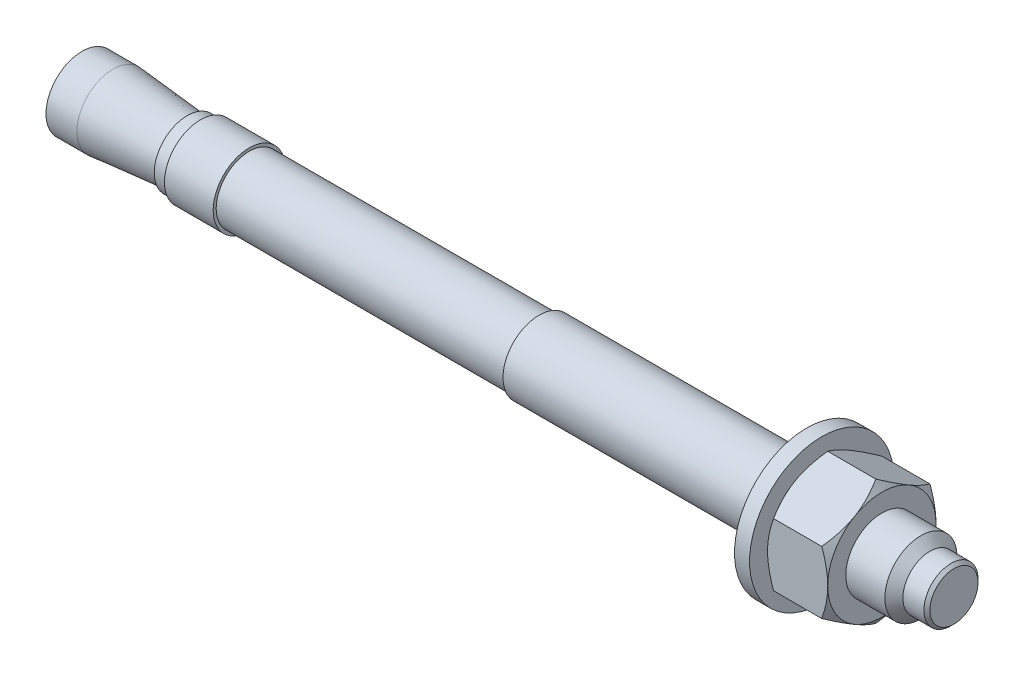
ISO-10303-21;
HEADER;
FILE_DESCRIPTION(('STEP AP214'),'2;1');
FILE_NAME('part.step','',(''),(''),'','','');
FILE_SCHEMA(('AUTOMOTIVE_DESIGN { 1 0 10303 214 1 1 1 1 }'));
ENDSEC;
DATA;
#1=APPLICATION_CONTEXT('core data for automotive mechanical design processes');
#2=APPLICATION_PROTOCOL_DEFINITION('international standard','automotive_design',2000,#1);
#3=PRODUCT_CONTEXT('',#1,'mechanical');
#4=PRODUCT('Part','Part','',(#3));
#5=PRODUCT_RELATED_PRODUCT_CATEGORY('part','',(#4));
#6=PRODUCT_DEFINITION_FORMATION('','',#4);
#7=PRODUCT_DEFINITION_CONTEXT('part definition',#1,'design');
#8=PRODUCT_DEFINITION('design','',#6,#7);
#9=PRODUCT_DEFINITION_SHAPE('','',#8);
#10=(LENGTH_UNIT() NAMED_UNIT(*) SI_UNIT(.MILLI.,.METRE.));
#11=(NAMED_UNIT(*) PLANE_ANGLE_UNIT() SI_UNIT($,.RADIAN.));
#12=(NAMED_UNIT(*) SI_UNIT($,.STERADIAN.) SOLID_ANGLE_UNIT());
#13=UNCERTAINTY_MEASURE_WITH_UNIT(LENGTH_MEASURE(1.E-05),#10,'distance_accuracy_value','');
#14=(GEOMETRIC_REPRESENTATION_CONTEXT(3) GLOBAL_UNCERTAINTY_ASSIGNED_CONTEXT((#13)) GLOBAL_UNIT_ASSIGNED_CONTEXT((#10,
#11,#12)) REPRESENTATION_CONTEXT('',''));
#15=CARTESIAN_POINT('',(0.,0.,0.));
#16=DIRECTION('',(0.,0.,1.));
#17=DIRECTION('',(1.,0.,0.));
#18=AXIS2_PLACEMENT_3D('',#15,#16,#17);
#19=CARTESIAN_POINT('',(145.,0.,0.));
#20=DIRECTION('',(1.,0.,0.));
#21=DIRECTION('',(0.,0.,-1.));
#22=AXIS2_PLACEMENT_3D('',#19,#20,#21);
#23=PLANE('',#22);
#24=CARTESIAN_POINT('',(144.999999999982,0.,0.));
#25=DIRECTION('',(-1.,0.,0.));
#26=DIRECTION('',(0.,0.,1.));
#27=AXIS2_PLACEMENT_3D('',#24,#25,#26);
#28=CIRCLE('',#27,4.0000000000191);
#29=CARTESIAN_POINT('',(144.999999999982,0.,4.0000000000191));
#30=VERTEX_POINT('',#29);
#31=EDGE_CURVE('E19',#30,#30,#28,.T.);
#32=ORIENTED_EDGE('',*,*,#31,.F.);
#33=EDGE_LOOP('',(#32));
#34=FACE_BOUND('',#33,.T.);
#35=ADVANCED_FACE('F16',(#34),#23,.T.);
#36=CARTESIAN_POINT('',(144.500000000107,0.,0.));
#37=DIRECTION('',(-1.,0.,0.));
#38=DIRECTION('',(0.,0.,1.));
#39=AXIS2_PLACEMENT_3D('',#36,#37,#38);
#40=CONICAL_SURFACE('',#39,4.49999999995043,0.785398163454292);
#41=ORIENTED_EDGE('',*,*,#31,.T.);
#42=EDGE_LOOP('',(#41));
#43=FACE_BOUND('',#42,.T.);
#44=CARTESIAN_POINT('',(144.5,0.,0.));
#45=DIRECTION('',(-1.,0.,0.));
#46=DIRECTION('',(0.,0.,1.));
#47=AXIS2_PLACEMENT_3D('',#44,#45,#46);
#48=CIRCLE('',#47,4.49999999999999);
#49=CARTESIAN_POINT('',(144.5,0.,4.49999999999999));
#50=VERTEX_POINT('',#49);
#51=EDGE_CURVE('E401',#50,#50,#48,.T.);
#52=ORIENTED_EDGE('',*,*,#51,.F.);
#53=EDGE_LOOP('',(#52));
#54=FACE_BOUND('',#53,.T.);
#55=ADVANCED_FACE('F730',(#43,#54),#40,.T.);
#56=CARTESIAN_POINT('',(169.981378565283,0.,0.));
#57=DIRECTION('',(-1.,0.,0.));
#58=DIRECTION('',(0.,0.,1.));
#59=AXIS2_PLACEMENT_3D('',#56,#57,#58);
#60=CYLINDRICAL_SURFACE('',#59,4.49999999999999);
#61=CARTESIAN_POINT('',(141.00000000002,0.,0.));
#62=DIRECTION('',(-1.,0.,0.));
#63=DIRECTION('',(0.,0.,1.));
#64=AXIS2_PLACEMENT_3D('',#61,#62,#63);
#65=CIRCLE('',#64,4.50000000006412);
#66=CARTESIAN_POINT('',(141.00000000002,0.,4.50000000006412));
#67=VERTEX_POINT('',#66);
#68=EDGE_CURVE('E398',#67,#67,#65,.T.);
#69=ORIENTED_EDGE('',*,*,#68,.F.);
#70=EDGE_LOOP('',(#69));
#71=FACE_BOUND('',#70,.T.);
#72=ORIENTED_EDGE('',*,*,#51,.T.);
#73=EDGE_LOOP('',(#72));
#74=FACE_BOUND('',#73,.T.);
#75=ADVANCED_FACE('F721',(#71,#74),#60,.T.);
#76=CARTESIAN_POINT('',(139.500000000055,0.,0.));
#77=DIRECTION('',(-1.,0.,0.));
#78=DIRECTION('',(0.,0.,1.));
#79=AXIS2_PLACEMENT_3D('',#76,#77,#78);
#80=CONICAL_SURFACE('',#79,5.99999999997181,0.785398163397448);
#81=ORIENTED_EDGE('',*,*,#68,.T.);
#82=EDGE_LOOP('',(#81));
#83=FACE_BOUND('',#82,.T.);
#84=CARTESIAN_POINT('',(139.5,0.,0.));
#85=DIRECTION('',(-1.,0.,0.));
#86=DIRECTION('',(0.,0.,1.));
#87=AXIS2_PLACEMENT_3D('',#84,#85,#86);
#88=CIRCLE('',#87,6.);
#89=CARTESIAN_POINT('',(139.5,0.,6.));
#90=VERTEX_POINT('',#89);
#91=EDGE_CURVE('E394',#90,#90,#88,.T.);
#92=ORIENTED_EDGE('',*,*,#91,.F.);
#93=EDGE_LOOP('',(#92));
#94=FACE_BOUND('',#93,.T.);
#95=ADVANCED_FACE('F712',(#83,#94),#80,.T.);
#96=CARTESIAN_POINT('',(169.981378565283,0.,0.));
#97=DIRECTION('',(-1.,0.,0.));
#98=DIRECTION('',(0.,0.,1.));
#99=AXIS2_PLACEMENT_3D('',#96,#97,#98);
#100=CYLINDRICAL_SURFACE('',#99,6.);
#101=CARTESIAN_POINT('',(133.,0.,0.));
#102=DIRECTION('',(-1.,0.,0.));
#103=DIRECTION('',(0.,0.,1.));
#104=AXIS2_PLACEMENT_3D('',#101,#102,#103);
#105=CIRCLE('',#104,6.);
#106=CARTESIAN_POINT('',(133.,0.,6.));
#107=VERTEX_POINT('',#106);
#108=EDGE_CURVE('E397',#107,#107,#105,.F.);
#109=ORIENTED_EDGE('',*,*,#108,.T.);
#110=EDGE_LOOP('',(#109));
#111=FACE_BOUND('',#110,.T.);
#112=ORIENTED_EDGE('',*,*,#91,.T.);
#113=EDGE_LOOP('',(#112));
#114=FACE_BOUND('',#113,.T.);
#115=ADVANCED_FACE('F703',(#111,#114),#100,.T.);
#116=CARTESIAN_POINT('',(0.,0.,0.));
#117=DIRECTION('',(1.,0.,0.));
#118=DIRECTION('',(0.,0.,-1.));
#119=AXIS2_PLACEMENT_3D('',#116,#117,#118);
#120=PLANE('',#119);
#121=CARTESIAN_POINT('',(0.,0.,0.));
#122=DIRECTION('',(-1.,0.,0.));
#123=DIRECTION('',(0.,0.,1.));
#124=AXIS2_PLACEMENT_3D('',#121,#122,#123);
#125=CIRCLE('',#124,6.);
#126=CARTESIAN_POINT('',(0.,0.,6.));
#127=VERTEX_POINT('',#126);
#128=EDGE_CURVE('E123',#127,#127,#125,.F.);
#129=ORIENTED_EDGE('',*,*,#128,.F.);
#130=EDGE_LOOP('',(#129));
#131=FACE_BOUND('',#130,.T.);
#132=ADVANCED_FACE('F695',(#131),#120,.F.);
#133=CARTESIAN_POINT('',(133.,0.,0.));
#134=DIRECTION('',(-1.,0.,0.));
#135=DIRECTION('',(0.,0.,1.));
#136=AXIS2_PLACEMENT_3D('',#133,#134,#135);
#137=PLANE('',#136);
#138=ORIENTED_EDGE('',*,*,#108,.F.);
#139=EDGE_LOOP('',(#138));
#140=FACE_BOUND('',#139,.T.);
#141=CARTESIAN_POINT('',(133.,0.,0.));
#142=DIRECTION('',(-1.,0.,0.));
#143=DIRECTION('',(0.,0.,1.));
#144=AXIS2_PLACEMENT_3D('',#141,#142,#143);
#145=CIRCLE('',#144,8.99999999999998);
#146=CARTESIAN_POINT('',(133.,-7.79422863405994,-4.49999999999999));
#147=VERTEX_POINT('',#146);
#148=CARTESIAN_POINT('',(133.,-7.79422863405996,4.5));
#149=VERTEX_POINT('',#148);
#150=EDGE_CURVE('E111',#147,#149,#145,.T.);
#151=ORIENTED_EDGE('',*,*,#150,.F.);
#152=CARTESIAN_POINT('',(133.,0.,0.));
#153=DIRECTION('',(-1.,0.,0.));
#154=DIRECTION('',(0.,0.,1.));
#155=AXIS2_PLACEMENT_3D('',#152,#153,#154);
#156=CIRCLE('',#155,8.99999999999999);
#157=CARTESIAN_POINT('',(133.,0.,-9.));
#158=VERTEX_POINT('',#157);
#159=EDGE_CURVE('E140',#158,#147,#156,.T.);
#160=ORIENTED_EDGE('',*,*,#159,.F.);
#161=CARTESIAN_POINT('',(133.,0.,0.));
#162=DIRECTION('',(-1.,0.,0.));
#163=DIRECTION('',(0.,0.,1.));
#164=AXIS2_PLACEMENT_3D('',#161,#162,#163);
#165=CIRCLE('',#164,8.99999999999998);
#166=CARTESIAN_POINT('',(133.,7.79422863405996,-4.5));
#167=VERTEX_POINT('',#166);
#168=EDGE_CURVE('E107',#167,#158,#165,.T.);
#169=ORIENTED_EDGE('',*,*,#168,.F.);
#170=CARTESIAN_POINT('',(133.,0.,0.));
#171=DIRECTION('',(-1.,0.,0.));
#172=DIRECTION('',(0.,0.,1.));
#173=AXIS2_PLACEMENT_3D('',#170,#171,#172);
#174=CIRCLE('',#173,8.99999999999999);
#175=CARTESIAN_POINT('',(133.,7.79422863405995,4.5));
#176=VERTEX_POINT('',#175);
#177=EDGE_CURVE('E104',#176,#167,#174,.T.);
#178=ORIENTED_EDGE('',*,*,#177,.F.);
#179=CARTESIAN_POINT('',(133.,0.,0.));
#180=DIRECTION('',(-1.,0.,0.));
#181=DIRECTION('',(0.,0.,1.));
#182=AXIS2_PLACEMENT_3D('',#179,#180,#181);
#183=CIRCLE('',#182,8.99999999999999);
#184=CARTESIAN_POINT('',(133.,0.,9.));
#185=VERTEX_POINT('',#184);
#186=EDGE_CURVE('E101',#185,#176,#183,.T.);
#187=ORIENTED_EDGE('',*,*,#186,.F.);
#188=CARTESIAN_POINT('',(133.,0.,0.));
#189=DIRECTION('',(-1.,0.,0.));
#190=DIRECTION('',(0.,0.,1.));
#191=AXIS2_PLACEMENT_3D('',#188,#189,#190);
#192=CIRCLE('',#191,8.99999999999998);
#193=EDGE_CURVE('E122',#149,#185,#192,.T.);
#194=ORIENTED_EDGE('',*,*,#193,.F.);
#195=EDGE_LOOP('',(#151,#160,#169,#178,#187,#194));
#196=FACE_BOUND('',#195,.T.);
#197=ADVANCED_FACE('F105',(#140,#196),#137,.F.);
#198=CARTESIAN_POINT('',(169.981378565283,0.,0.));
#199=DIRECTION('',(-1.,0.,0.));
#200=DIRECTION('',(0.,0.,1.));
#201=AXIS2_PLACEMENT_3D('',#198,#199,#200);
#202=CYLINDRICAL_SURFACE('',#201,6.);
#203=ORIENTED_EDGE('',*,*,#128,.T.);
#204=EDGE_LOOP('',(#203));
#205=FACE_BOUND('',#204,.T.);
#206=CARTESIAN_POINT('',(5.14093200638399,0.,0.));
#207=DIRECTION('',(-1.,0.,0.));
#208=DIRECTION('',(0.,0.,1.));
#209=AXIS2_PLACEMENT_3D('',#206,#207,#208);
#210=CIRCLE('',#209,5.99999999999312);
#211=CARTESIAN_POINT('',(5.14093200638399,0.,5.99999999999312));
#212=VERTEX_POINT('',#211);
#213=EDGE_CURVE('E137',#212,#212,#210,.F.);
#214=ORIENTED_EDGE('',*,*,#213,.F.);
#215=EDGE_LOOP('',(#214));
#216=FACE_BOUND('',#215,.T.);
#217=ADVANCED_FACE('F162',(#205,#216),#202,.T.);
#218=CARTESIAN_POINT('',(131.994,0.,0.));
#219=DIRECTION('',(-1.,0.,0.));
#220=DIRECTION('',(0.,0.,1.));
#221=AXIS2_PLACEMENT_3D('',#218,#219,#220);
#222=CONICAL_SURFACE('',#221,10.4006586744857,0.947937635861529);
#223=CARTESIAN_POINT('',(133.,0.,9.00000000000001));
#224=CARTESIAN_POINT('',(133.000027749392,0.186994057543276,9.00000000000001));
#225=CARTESIAN_POINT('',(132.995814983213,0.373979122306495,9.00000000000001));
#226=CARTESIAN_POINT('',(132.979114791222,0.747543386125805,9.00000000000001));
#227=CARTESIAN_POINT('',(132.966629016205,0.93412265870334,9.00000000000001));
#228=CARTESIAN_POINT('',(132.933617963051,1.30623614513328,9.00000000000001));
#229=CARTESIAN_POINT('',(132.913106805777,1.49177161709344,9.00000000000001));
#230=CARTESIAN_POINT('',(132.864426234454,1.8618302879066,9.00000000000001));
#231=CARTESIAN_POINT('',(132.836256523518,2.04635344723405,9.00000000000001));
#232=CARTESIAN_POINT('',(132.741609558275,2.59416787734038,9.00000000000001));
#233=CARTESIAN_POINT('',(132.664623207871,2.95567293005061,9.00000000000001));
#234=CARTESIAN_POINT('',(132.486688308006,3.67267890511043,9.00000000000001));
#235=CARTESIAN_POINT('',(132.385735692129,4.02817879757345,9.00000000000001));
#236=CARTESIAN_POINT('',(132.232005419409,4.51725033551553,9.00000000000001));
#237=CARTESIAN_POINT('',(132.187552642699,4.65350088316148,9.00000000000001));
#238=CARTESIAN_POINT('',(132.095822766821,4.92536856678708,9.00000000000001));
#239=CARTESIAN_POINT('',(132.048539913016,5.06098376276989,9.00000000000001));
#240=CARTESIAN_POINT('',(132.,5.19615242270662,9.00000000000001));
#241=B_SPLINE_CURVE_WITH_KNOTS('',3,(#223,#224,#225,#226,#227,#228,#229,#230,#231,#232,#233,
#234,#235,#236,#237,#238,#239,#240),.UNSPECIFIED.,.F.,.F.,(4,2,2,2,2,2,2,2,4),(0.,
0.560919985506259,1.12172807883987,1.68155382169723,2.24140126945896,3.34917257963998,
4.45713198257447,4.88706787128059,5.3179098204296),.UNSPECIFIED.);
#242=CARTESIAN_POINT('',(132.,5.19615242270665,9.));
#243=VERTEX_POINT('',#242);
#244=EDGE_CURVE('E120',#185,#243,#241,.T.);
#245=ORIENTED_EDGE('',*,*,#244,.F.);
#246=ORIENTED_EDGE('',*,*,#186,.T.);
#247=CARTESIAN_POINT('',(132.,5.19615242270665,8.99999999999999));
#248=CARTESIAN_POINT('',(132.075079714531,5.30069863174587,8.81892065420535));
#249=CARTESIAN_POINT('',(132.147174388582,5.40579672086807,8.6368854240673));
#250=CARTESIAN_POINT('',(132.284526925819,5.61714620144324,8.27081738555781));
#251=CARTESIAN_POINT('',(132.349782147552,5.72339802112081,8.08678383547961));
#252=CARTESIAN_POINT('',(132.472059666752,5.93620569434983,7.71819013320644));
#253=CARTESIAN_POINT('',(132.529141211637,6.04275298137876,7.53364481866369));
#254=CARTESIAN_POINT('',(132.634721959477,6.25690027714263,7.16273082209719));
#255=CARTESIAN_POINT('',(132.683221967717,6.36450018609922,6.97636231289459));
#256=CARTESIAN_POINT('',(132.770806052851,6.58087261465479,6.60159427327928));
#257=CARTESIAN_POINT('',(132.809872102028,6.68964697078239,6.41319156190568));
#258=CARTESIAN_POINT('',(132.877617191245,6.90800097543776,6.03499133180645));
#259=CARTESIAN_POINT('',(132.906296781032,7.01758058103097,5.84519388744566));
#260=CARTESIAN_POINT('',(132.952729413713,7.23815834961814,5.4631419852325));
#261=CARTESIAN_POINT('',(132.970398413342,7.34916097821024,5.27087979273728));
#262=CARTESIAN_POINT('',(132.994063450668,7.57151533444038,4.88575075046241));
#263=CARTESIAN_POINT('',(133.00005528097,7.68286717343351,4.69288370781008));
#264=CARTESIAN_POINT('',(133.,7.79422863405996,4.49999999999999));
#265=B_SPLINE_CURVE_WITH_KNOTS('',3,(#247,#248,#249,#250,#251,#252,#253,#254,#255,#256,#257,
#258,#259,#260,#261,#262,#263,#264),.UNSPECIFIED.,.F.,.F.,(4,2,2,2,2,2,2,2,4),(0.,
0.666512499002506,1.33328146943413,1.9949418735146,2.65654015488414,3.31939287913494,
3.98221051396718,4.6500273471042,5.31808475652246),.UNSPECIFIED.);
#266=EDGE_CURVE('E117',#243,#176,#265,.T.);
#267=ORIENTED_EDGE('',*,*,#266,.F.);
#268=EDGE_LOOP('',(#245,#246,#267));
#269=FACE_BOUND('',#268,.T.);
#270=ADVANCED_FACE('F115',(#269),#222,.T.);
#271=CARTESIAN_POINT('',(131.994,0.,0.));
#272=DIRECTION('',(-1.,0.,0.));
#273=DIRECTION('',(0.,0.,1.));
#274=AXIS2_PLACEMENT_3D('',#271,#272,#273);
#275=CONICAL_SURFACE('',#274,10.4006586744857,0.947937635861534);
#276=CARTESIAN_POINT('',(133.,-7.79422863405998,4.50000000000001));
#277=CARTESIAN_POINT('',(133.000027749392,-7.70073160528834,4.66194160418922));
#278=CARTESIAN_POINT('',(132.995814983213,-7.60723907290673,4.82387542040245));
#279=CARTESIAN_POINT('',(132.979114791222,-7.42045694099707,5.147391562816));
#280=CARTESIAN_POINT('',(132.966629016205,-7.3271673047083,5.30897395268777));
#281=CARTESIAN_POINT('',(132.933617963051,-7.14111056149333,5.6312336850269));
#282=CARTESIAN_POINT('',(132.913106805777,-7.04834282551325,5.79191211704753));
#283=CARTESIAN_POINT('',(132.864426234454,-6.86331349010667,6.11239232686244));
#284=CARTESIAN_POINT('',(132.836256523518,-6.77105191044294,6.27219407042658));
#285=CARTESIAN_POINT('',(132.741609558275,-6.49714469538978,6.74661528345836));
#286=CARTESIAN_POINT('',(132.664623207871,-6.31639216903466,7.05968784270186));
#287=CARTESIAN_POINT('',(132.486688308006,-5.95788918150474,7.68063323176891));
#288=CARTESIAN_POINT('',(132.385735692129,-5.78013923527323,7.98850516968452));
#289=CARTESIAN_POINT('',(132.232005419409,-5.5356034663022,8.41205354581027));
#290=CARTESIAN_POINT('',(132.187552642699,-5.46747819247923,8.5300499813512));
#291=CARTESIAN_POINT('',(132.095822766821,-5.33154435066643,8.76549430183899));
#292=CARTESIAN_POINT('',(132.048539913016,-5.26373675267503,8.8829405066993));
#293=CARTESIAN_POINT('',(132.,-5.19615242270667,9.));
#294=B_SPLINE_CURVE_WITH_KNOTS('',3,(#276,#277,#278,#279,#280,#281,#282,#283,#284,#285,#286,
#287,#288,#289,#290,#291,#292,#293),.UNSPECIFIED.,.F.,.F.,(4,2,2,2,2,2,2,2,4),(0.,
0.560919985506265,1.12172807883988,1.68155382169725,2.24140126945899,3.34917257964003,
4.45713198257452,4.88706787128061,5.31790982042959),.UNSPECIFIED.);
#295=CARTESIAN_POINT('',(132.,-5.19615242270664,9.00000000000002));
#296=VERTEX_POINT('',#295);
#297=EDGE_CURVE('E282',#149,#296,#294,.T.);
#298=ORIENTED_EDGE('',*,*,#297,.F.);
#299=ORIENTED_EDGE('',*,*,#193,.T.);
#300=CARTESIAN_POINT('',(132.,-5.19615242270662,9.00000000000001));
#301=CARTESIAN_POINT('',(132.075079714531,-4.98706000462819,9.00000000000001));
#302=CARTESIAN_POINT('',(132.147174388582,-4.77686382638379,9.00000000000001));
#303=CARTESIAN_POINT('',(132.284526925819,-4.35416486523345,9.00000000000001));
#304=CARTESIAN_POINT('',(132.349782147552,-4.14166122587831,9.00000000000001));
#305=CARTESIAN_POINT('',(132.472059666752,-3.71604587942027,9.00000000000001));
#306=CARTESIAN_POINT('',(132.529141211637,-3.5029513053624,9.00000000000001));
#307=CARTESIAN_POINT('',(132.634721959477,-3.07465671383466,9.00000000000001));
#308=CARTESIAN_POINT('',(132.683221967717,-2.85945689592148,9.00000000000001));
#309=CARTESIAN_POINT('',(132.770806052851,-2.42671203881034,9.00000000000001));
#310=CARTESIAN_POINT('',(132.809872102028,-2.20916332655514,9.00000000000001));
#311=CARTESIAN_POINT('',(132.877617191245,-1.7724553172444,9.00000000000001));
#312=CARTESIAN_POINT('',(132.906296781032,-1.55329610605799,9.00000000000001));
#313=CARTESIAN_POINT('',(132.952729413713,-1.11214056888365,9.00000000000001));
#314=CARTESIAN_POINT('',(132.970398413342,-0.890135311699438,9.00000000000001));
#315=CARTESIAN_POINT('',(132.994063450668,-0.445426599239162,9.00000000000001));
#316=CARTESIAN_POINT('',(133.00005528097,-0.2227229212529,9.00000000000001));
#317=CARTESIAN_POINT('',(133.,0.,9.00000000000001));
#318=B_SPLINE_CURVE_WITH_KNOTS('',3,(#300,#301,#302,#303,#304,#305,#306,#307,#308,#309,#310,
#311,#312,#313,#314,#315,#316,#317),.UNSPECIFIED.,.F.,.F.,(4,2,2,2,2,2,2,2,4),(0.,
0.6665124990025,1.33328146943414,1.9949418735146,2.65654015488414,3.31939287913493,
3.98221051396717,4.65002734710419,5.31808475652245),.UNSPECIFIED.);
#319=EDGE_CURVE('E132',#296,#185,#318,.T.);
#320=ORIENTED_EDGE('',*,*,#319,.F.);
#321=EDGE_LOOP('',(#298,#299,#320));
#322=FACE_BOUND('',#321,.T.);
#323=ADVANCED_FACE('F161',(#322),#275,.T.);
#324=CARTESIAN_POINT('',(131.994,0.,0.));
#325=DIRECTION('',(-1.,0.,0.));
#326=DIRECTION('',(0.,0.,1.));
#327=AXIS2_PLACEMENT_3D('',#324,#325,#326);
#328=CONICAL_SURFACE('',#327,10.4006586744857,0.947937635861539);
#329=CARTESIAN_POINT('',(133.,-7.79422863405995,-4.5));
#330=CARTESIAN_POINT('',(133.000027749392,-7.88772566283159,-4.33805839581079));
#331=CARTESIAN_POINT('',(132.995814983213,-7.9812181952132,-4.17612457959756));
#332=CARTESIAN_POINT('',(132.979114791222,-8.16800032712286,-3.852608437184));
#333=CARTESIAN_POINT('',(132.966629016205,-8.26128996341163,-3.69102604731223));
#334=CARTESIAN_POINT('',(132.933617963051,-8.4473467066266,-3.3687663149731));
#335=CARTESIAN_POINT('',(132.913106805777,-8.54011444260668,-3.20808788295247));
#336=CARTESIAN_POINT('',(132.864426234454,-8.72514377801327,-2.88760767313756));
#337=CARTESIAN_POINT('',(132.836256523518,-8.817405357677,-2.72780592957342));
#338=CARTESIAN_POINT('',(132.741609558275,-9.09131257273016,-2.25338471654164));
#339=CARTESIAN_POINT('',(132.664623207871,-9.27206509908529,-1.94031215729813));
#340=CARTESIAN_POINT('',(132.486688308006,-9.63056808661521,-1.31936676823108));
#341=CARTESIAN_POINT('',(132.385735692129,-9.80831803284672,-1.01149483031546));
#342=CARTESIAN_POINT('',(132.232005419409,-10.0528538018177,-0.587946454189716));
#343=CARTESIAN_POINT('',(132.187552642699,-10.1209790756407,-0.469950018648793));
#344=CARTESIAN_POINT('',(132.095822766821,-10.2569129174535,-0.23450569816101));
#345=CARTESIAN_POINT('',(132.048539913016,-10.3247205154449,-0.117059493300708));
#346=CARTESIAN_POINT('',(132.,-10.3923048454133,0.));
#347=B_SPLINE_CURVE_WITH_KNOTS('',3,(#329,#330,#331,#332,#333,#334,#335,#336,#337,#338,#339,
#340,#341,#342,#343,#344,#345,#346),.UNSPECIFIED.,.F.,.F.,(4,2,2,2,2,2,2,2,4),(0.,
0.560919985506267,1.12172807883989,1.68155382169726,2.241401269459,3.34917257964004,
4.45713198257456,4.88706787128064,5.31790982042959),.UNSPECIFIED.);
#348=CARTESIAN_POINT('',(132.,-10.3923048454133,0.));
#349=VERTEX_POINT('',#348);
#350=EDGE_CURVE('E276',#147,#349,#347,.T.);
#351=ORIENTED_EDGE('',*,*,#350,.F.);
#352=ORIENTED_EDGE('',*,*,#150,.T.);
#353=CARTESIAN_POINT('',(132.,-10.3923048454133,0.));
#354=CARTESIAN_POINT('',(132.075079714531,-10.2877586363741,0.181079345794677));
#355=CARTESIAN_POINT('',(132.147174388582,-10.1826605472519,0.363114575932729));
#356=CARTESIAN_POINT('',(132.284526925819,-9.97131106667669,0.729182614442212));
#357=CARTESIAN_POINT('',(132.349782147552,-9.86505924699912,0.913216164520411));
#358=CARTESIAN_POINT('',(132.472059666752,-9.65225157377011,1.28180986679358));
#359=CARTESIAN_POINT('',(132.529141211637,-9.54570428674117,1.46635518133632));
#360=CARTESIAN_POINT('',(132.634721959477,-9.3315569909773,1.83726917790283));
#361=CARTESIAN_POINT('',(132.683221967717,-9.22395708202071,2.02363768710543));
#362=CARTESIAN_POINT('',(132.770806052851,-9.00758465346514,2.39840572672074));
#363=CARTESIAN_POINT('',(132.809872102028,-8.89881029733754,2.58680843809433));
#364=CARTESIAN_POINT('',(132.877617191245,-8.68045629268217,2.96500866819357));
#365=CARTESIAN_POINT('',(132.906296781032,-8.57087668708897,3.15480611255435));
#366=CARTESIAN_POINT('',(132.952729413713,-8.35029891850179,3.53685801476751));
#367=CARTESIAN_POINT('',(132.970398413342,-8.23929628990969,3.72912020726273));
#368=CARTESIAN_POINT('',(132.994063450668,-8.01694193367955,4.1142492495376));
#369=CARTESIAN_POINT('',(133.00005528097,-7.90559009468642,4.30711629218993));
#370=CARTESIAN_POINT('',(133.,-7.79422863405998,4.50000000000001));
#371=B_SPLINE_CURVE_WITH_KNOTS('',3,(#353,#354,#355,#356,#357,#358,#359,#360,#361,#362,#363,
#364,#365,#366,#367,#368,#369,#370),.UNSPECIFIED.,.F.,.F.,(4,2,2,2,2,2,2,2,4),(0.,
0.666512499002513,1.33328146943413,1.9949418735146,2.65654015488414,3.31939287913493,
3.98221051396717,4.65002734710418,5.31808475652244),.UNSPECIFIED.);
#372=EDGE_CURVE('E172',#349,#149,#371,.T.);
#373=ORIENTED_EDGE('',*,*,#372,.F.);
#374=EDGE_LOOP('',(#351,#352,#373));
#375=FACE_BOUND('',#374,.T.);
#376=ADVANCED_FACE('F662',(#375),#328,.T.);
#377=CARTESIAN_POINT('',(131.994,0.,0.));
#378=DIRECTION('',(-1.,0.,0.));
#379=DIRECTION('',(0.,0.,1.));
#380=AXIS2_PLACEMENT_3D('',#377,#378,#379);
#381=CONICAL_SURFACE('',#380,10.4006586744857,0.947937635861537);
#382=CARTESIAN_POINT('',(132.,10.3923048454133,0.));
#383=CARTESIAN_POINT('',(132.075079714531,10.2877586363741,-0.181079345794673));
#384=CARTESIAN_POINT('',(132.147174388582,10.1826605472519,-0.363114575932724));
#385=CARTESIAN_POINT('',(132.284526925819,9.9713110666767,-0.729182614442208));
#386=CARTESIAN_POINT('',(132.349782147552,9.86505924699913,-0.913216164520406));
#387=CARTESIAN_POINT('',(132.472059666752,9.65225157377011,-1.28180986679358));
#388=CARTESIAN_POINT('',(132.529141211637,9.54570428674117,-1.46635518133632));
#389=CARTESIAN_POINT('',(132.634721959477,9.3315569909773,-1.83726917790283));
#390=CARTESIAN_POINT('',(132.683221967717,9.22395708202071,-2.02363768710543));
#391=CARTESIAN_POINT('',(132.770806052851,9.00758465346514,-2.39840572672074));
#392=CARTESIAN_POINT('',(132.809872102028,8.89881029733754,-2.58680843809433));
#393=CARTESIAN_POINT('',(132.877617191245,8.68045629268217,-2.96500866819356));
#394=CARTESIAN_POINT('',(132.906296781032,8.57087668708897,-3.15480611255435));
#395=CARTESIAN_POINT('',(132.952729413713,8.35029891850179,-3.53685801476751));
#396=CARTESIAN_POINT('',(132.970398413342,8.23929628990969,-3.72912020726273));
#397=CARTESIAN_POINT('',(132.994063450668,8.01694193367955,-4.1142492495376));
#398=CARTESIAN_POINT('',(133.00005528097,7.90559009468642,-4.30711629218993));
#399=CARTESIAN_POINT('',(133.,7.79422863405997,-4.50000000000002));
#400=B_SPLINE_CURVE_WITH_KNOTS('',3,(#382,#383,#384,#385,#386,#387,#388,#389,#390,#391,#392,
#393,#394,#395,#396,#397,#398,#399),.UNSPECIFIED.,.F.,.F.,(4,2,2,2,2,2,2,2,4),(0.,
0.666512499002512,1.33328146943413,1.99494187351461,2.65654015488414,3.31939287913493,
3.98221051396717,4.65002734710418,5.31808475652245),.UNSPECIFIED.);
#401=CARTESIAN_POINT('',(132.,10.3923048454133,0.));
#402=VERTEX_POINT('',#401);
#403=EDGE_CURVE('E129',#402,#167,#400,.T.);
#404=ORIENTED_EDGE('',*,*,#403,.F.);
#405=CARTESIAN_POINT('',(133.,7.79422863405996,4.5));
#406=CARTESIAN_POINT('',(133.000027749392,7.8877256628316,4.33805839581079));
#407=CARTESIAN_POINT('',(132.995814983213,7.98121819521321,4.17612457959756));
#408=CARTESIAN_POINT('',(132.979114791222,8.16800032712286,3.852608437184));
#409=CARTESIAN_POINT('',(132.966629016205,8.26128996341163,3.69102604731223));
#410=CARTESIAN_POINT('',(132.933617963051,8.44734670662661,3.3687663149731));
#411=CARTESIAN_POINT('',(132.913106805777,8.54011444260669,3.20808788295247));
#412=CARTESIAN_POINT('',(132.864426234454,8.72514377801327,2.88760767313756));
#413=CARTESIAN_POINT('',(132.836256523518,8.817405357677,2.72780592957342));
#414=CARTESIAN_POINT('',(132.741609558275,9.09131257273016,2.25338471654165));
#415=CARTESIAN_POINT('',(132.664623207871,9.27206509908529,1.94031215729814));
#416=CARTESIAN_POINT('',(132.486688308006,9.6305680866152,1.31936676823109));
#417=CARTESIAN_POINT('',(132.385735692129,9.80831803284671,1.01149483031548));
#418=CARTESIAN_POINT('',(132.232005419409,10.0528538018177,0.587946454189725));
#419=CARTESIAN_POINT('',(132.187552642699,10.1209790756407,0.469950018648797));
#420=CARTESIAN_POINT('',(132.095822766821,10.2569129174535,0.234505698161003));
#421=CARTESIAN_POINT('',(132.048539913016,10.3247205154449,0.117059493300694));
#422=CARTESIAN_POINT('',(132.,10.3923048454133,0.));
#423=B_SPLINE_CURVE_WITH_KNOTS('',3,(#405,#406,#407,#408,#409,#410,#411,#412,#413,#414,#415,
#416,#417,#418,#419,#420,#421,#422),.UNSPECIFIED.,.F.,.F.,(4,2,2,2,2,2,2,2,4),(0.,
0.560919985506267,1.12172807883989,1.68155382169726,2.24140126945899,3.34917257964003,
4.45713198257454,4.88706787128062,5.31790982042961),.UNSPECIFIED.);
#424=EDGE_CURVE('E126',#176,#402,#423,.T.);
#425=ORIENTED_EDGE('',*,*,#424,.F.);
#426=ORIENTED_EDGE('',*,*,#177,.T.);
#427=EDGE_LOOP('',(#404,#425,#426));
#428=FACE_BOUND('',#427,.T.);
#429=ADVANCED_FACE('F127',(#428),#381,.T.);
#430=CARTESIAN_POINT('',(131.994,0.,0.));
#431=DIRECTION('',(-1.,0.,0.));
#432=DIRECTION('',(0.,0.,1.));
#433=AXIS2_PLACEMENT_3D('',#430,#431,#432);
#434=CONICAL_SURFACE('',#433,10.4006586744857,0.947937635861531);
#435=CARTESIAN_POINT('',(133.,7.79422863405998,-4.50000000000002));
#436=CARTESIAN_POINT('',(133.000027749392,7.70073160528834,-4.66194160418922));
#437=CARTESIAN_POINT('',(132.995814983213,7.60723907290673,-4.82387542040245));
#438=CARTESIAN_POINT('',(132.979114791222,7.42045694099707,-5.14739156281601));
#439=CARTESIAN_POINT('',(132.966629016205,7.3271673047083,-5.30897395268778));
#440=CARTESIAN_POINT('',(132.933617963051,7.14111056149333,-5.6312336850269));
#441=CARTESIAN_POINT('',(132.913106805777,7.04834282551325,-5.79191211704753));
#442=CARTESIAN_POINT('',(132.864426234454,6.86331349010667,-6.11239232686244));
#443=CARTESIAN_POINT('',(132.836256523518,6.77105191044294,-6.27219407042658));
#444=CARTESIAN_POINT('',(132.741609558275,6.49714469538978,-6.74661528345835));
#445=CARTESIAN_POINT('',(132.664623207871,6.31639216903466,-7.05968784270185));
#446=CARTESIAN_POINT('',(132.486688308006,5.95788918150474,-7.6806332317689));
#447=CARTESIAN_POINT('',(132.385735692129,5.78013923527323,-7.98850516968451));
#448=CARTESIAN_POINT('',(132.232005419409,5.5356034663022,-8.41205354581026));
#449=CARTESIAN_POINT('',(132.187552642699,5.46747819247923,-8.53004998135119));
#450=CARTESIAN_POINT('',(132.095822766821,5.33154435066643,-8.76549430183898));
#451=CARTESIAN_POINT('',(132.048539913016,5.26373675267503,-8.88294050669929));
#452=CARTESIAN_POINT('',(132.,5.19615242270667,-9.));
#453=B_SPLINE_CURVE_WITH_KNOTS('',3,(#435,#436,#437,#438,#439,#440,#441,#442,#443,#444,#445,
#446,#447,#448,#449,#450,#451,#452),.UNSPECIFIED.,.F.,.F.,(4,2,2,2,2,2,2,2,4),(0.,
0.560919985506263,1.12172807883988,1.68155382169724,2.24140126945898,3.34917257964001,
4.4571319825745,4.8870678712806,5.31790982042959),.UNSPECIFIED.);
#454=CARTESIAN_POINT('',(132.,5.19615242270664,-9.00000000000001));
#455=VERTEX_POINT('',#454);
#456=EDGE_CURVE('E384',#167,#455,#453,.T.);
#457=ORIENTED_EDGE('',*,*,#456,.F.);
#458=ORIENTED_EDGE('',*,*,#168,.T.);
#459=CARTESIAN_POINT('',(132.,5.19615242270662,-9.00000000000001));
#460=CARTESIAN_POINT('',(132.075079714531,4.98706000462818,-9.00000000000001));
#461=CARTESIAN_POINT('',(132.147174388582,4.77686382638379,-9.00000000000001));
#462=CARTESIAN_POINT('',(132.284526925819,4.35416486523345,-9.00000000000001));
#463=CARTESIAN_POINT('',(132.349782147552,4.14166122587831,-9.00000000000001));
#464=CARTESIAN_POINT('',(132.472059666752,3.71604587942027,-9.00000000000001));
#465=CARTESIAN_POINT('',(132.529141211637,3.5029513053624,-9.00000000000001));
#466=CARTESIAN_POINT('',(132.634721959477,3.07465671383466,-9.00000000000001));
#467=CARTESIAN_POINT('',(132.683221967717,2.85945689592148,-9.00000000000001));
#468=CARTESIAN_POINT('',(132.770806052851,2.42671203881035,-9.00000000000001));
#469=CARTESIAN_POINT('',(132.809872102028,2.20916332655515,-9.00000000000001));
#470=CARTESIAN_POINT('',(132.877617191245,1.77245531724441,-9.00000000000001));
#471=CARTESIAN_POINT('',(132.906296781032,1.553296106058,-9.00000000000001));
#472=CARTESIAN_POINT('',(132.952729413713,1.11214056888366,-9.00000000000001));
#473=CARTESIAN_POINT('',(132.970398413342,0.890135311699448,-9.00000000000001));
#474=CARTESIAN_POINT('',(132.994063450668,0.44542659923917,-9.00000000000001));
#475=CARTESIAN_POINT('',(133.00005528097,0.222722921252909,-9.00000000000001));
#476=CARTESIAN_POINT('',(133.,0.,-9.00000000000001));
#477=B_SPLINE_CURVE_WITH_KNOTS('',3,(#459,#460,#461,#462,#463,#464,#465,#466,#467,#468,#469,
#470,#471,#472,#473,#474,#475,#476),.UNSPECIFIED.,.F.,.F.,(4,2,2,2,2,2,2,2,4),(0.,
0.666512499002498,1.33328146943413,1.99494187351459,2.65654015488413,3.31939287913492,
3.98221051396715,4.65002734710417,5.31808475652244),.UNSPECIFIED.);
#478=EDGE_CURVE('E253',#455,#158,#477,.T.);
#479=ORIENTED_EDGE('',*,*,#478,.F.);
#480=EDGE_LOOP('',(#457,#458,#479));
#481=FACE_BOUND('',#480,.T.);
#482=ADVANCED_FACE('F265',(#481),#434,.T.);
#483=CARTESIAN_POINT('',(131.994,0.,0.));
#484=DIRECTION('',(-1.,0.,0.));
#485=DIRECTION('',(0.,0.,1.));
#486=AXIS2_PLACEMENT_3D('',#483,#484,#485);
#487=CONICAL_SURFACE('',#486,10.4006586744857,0.947937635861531);
#488=CARTESIAN_POINT('',(133.,0.,-9.00000000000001));
#489=CARTESIAN_POINT('',(133.000027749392,-0.186994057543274,-9.00000000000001));
#490=CARTESIAN_POINT('',(132.995814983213,-0.373979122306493,-9.00000000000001));
#491=CARTESIAN_POINT('',(132.979114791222,-0.747543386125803,-9.00000000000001));
#492=CARTESIAN_POINT('',(132.966629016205,-0.934122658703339,-9.00000000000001));
#493=CARTESIAN_POINT('',(132.933617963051,-1.30623614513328,-9.00000000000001));
#494=CARTESIAN_POINT('',(132.913106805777,-1.49177161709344,-9.00000000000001));
#495=CARTESIAN_POINT('',(132.864426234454,-1.8618302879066,-9.00000000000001));
#496=CARTESIAN_POINT('',(132.836256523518,-2.04635344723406,-9.00000000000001));
#497=CARTESIAN_POINT('',(132.741609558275,-2.59416787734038,-9.00000000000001));
#498=CARTESIAN_POINT('',(132.664623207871,-2.95567293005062,-9.00000000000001));
#499=CARTESIAN_POINT('',(132.486688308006,-3.67267890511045,-9.00000000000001));
#500=CARTESIAN_POINT('',(132.385735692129,-4.02817879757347,-9.00000000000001));
#501=CARTESIAN_POINT('',(132.232005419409,-4.51725033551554,-9.00000000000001));
#502=CARTESIAN_POINT('',(132.187552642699,-4.65350088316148,-9.00000000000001));
#503=CARTESIAN_POINT('',(132.095822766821,-4.92536856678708,-9.00000000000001));
#504=CARTESIAN_POINT('',(132.048539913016,-5.06098376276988,-9.00000000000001));
#505=CARTESIAN_POINT('',(132.,-5.19615242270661,-9.00000000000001));
#506=B_SPLINE_CURVE_WITH_KNOTS('',3,(#488,#489,#490,#491,#492,#493,#494,#495,#496,#497,#498,
#499,#500,#501,#502,#503,#504,#505),.UNSPECIFIED.,.F.,.F.,(4,2,2,2,2,2,2,2,4),(0.,
0.560919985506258,1.12172807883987,1.68155382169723,2.24140126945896,3.34917257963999,
4.4571319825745,4.8870678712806,5.31790982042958),.UNSPECIFIED.);
#507=CARTESIAN_POINT('',(132.,-5.19615242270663,-9.00000000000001));
#508=VERTEX_POINT('',#507);
#509=EDGE_CURVE('E245',#158,#508,#506,.T.);
#510=ORIENTED_EDGE('',*,*,#509,.F.);
#511=ORIENTED_EDGE('',*,*,#159,.T.);
#512=CARTESIAN_POINT('',(132.,-5.19615242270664,-9.));
#513=CARTESIAN_POINT('',(132.075079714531,-5.30069863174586,-8.81892065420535));
#514=CARTESIAN_POINT('',(132.147174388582,-5.40579672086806,-8.6368854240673));
#515=CARTESIAN_POINT('',(132.284526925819,-5.61714620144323,-8.27081738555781));
#516=CARTESIAN_POINT('',(132.349782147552,-5.7233980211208,-8.08678383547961));
#517=CARTESIAN_POINT('',(132.472059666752,-5.93620569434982,-7.71819013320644));
#518=CARTESIAN_POINT('',(132.529141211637,-6.04275298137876,-7.53364481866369));
#519=CARTESIAN_POINT('',(132.634721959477,-6.25690027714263,-7.16273082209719));
#520=CARTESIAN_POINT('',(132.683221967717,-6.36450018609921,-6.97636231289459));
#521=CARTESIAN_POINT('',(132.770806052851,-6.58087261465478,-6.60159427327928));
#522=CARTESIAN_POINT('',(132.809872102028,-6.68964697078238,-6.41319156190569));
#523=CARTESIAN_POINT('',(132.877617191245,-6.90800097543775,-6.03499133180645));
#524=CARTESIAN_POINT('',(132.906296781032,-7.01758058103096,-5.84519388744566));
#525=CARTESIAN_POINT('',(132.952729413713,-7.23815834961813,-5.46314198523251));
#526=CARTESIAN_POINT('',(132.970398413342,-7.34916097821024,-5.27087979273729));
#527=CARTESIAN_POINT('',(132.994063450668,-7.57151533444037,-4.88575075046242));
#528=CARTESIAN_POINT('',(133.00005528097,-7.68286717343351,-4.69288370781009));
#529=CARTESIAN_POINT('',(133.,-7.79422863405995,-4.5));
#530=B_SPLINE_CURVE_WITH_KNOTS('',3,(#512,#513,#514,#515,#516,#517,#518,#519,#520,#521,#522,
#523,#524,#525,#526,#527,#528,#529),.UNSPECIFIED.,.F.,.F.,(4,2,2,2,2,2,2,2,4),(0.,
0.666512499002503,1.33328146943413,1.9949418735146,2.65654015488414,3.31939287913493,
3.98221051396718,4.65002734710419,5.31808475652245),.UNSPECIFIED.);
#531=EDGE_CURVE('E270',#508,#147,#530,.T.);
#532=ORIENTED_EDGE('',*,*,#531,.F.);
#533=EDGE_LOOP('',(#510,#511,#532));
#534=FACE_BOUND('',#533,.T.);
#535=ADVANCED_FACE('F261',(#534),#487,.T.);
#536=CARTESIAN_POINT('',(5.14093200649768,0.,0.));
#537=DIRECTION('',(-1.,0.,0.));
#538=DIRECTION('',(0.,0.,1.));
#539=AXIS2_PLACEMENT_3D('',#536,#537,#538);
#540=CONICAL_SURFACE('',#539,5.99999999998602,0.087266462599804);
#541=CARTESIAN_POINT('',(17.4999999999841,0.,0.));
#542=DIRECTION('',(-1.,0.,0.));
#543=DIRECTION('',(0.,0.,1.));
#544=AXIS2_PLACEMENT_3D('',#541,#542,#543);
#545=CIRCLE('',#544,4.91872165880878);
#546=CARTESIAN_POINT('',(17.4999999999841,0.,4.91872165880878));
#547=VERTEX_POINT('',#546);
#548=EDGE_CURVE('E241',#547,#547,#545,.T.);
#549=ORIENTED_EDGE('',*,*,#548,.T.);
#550=EDGE_LOOP('',(#549));
#551=FACE_BOUND('',#550,.T.);
#552=ORIENTED_EDGE('',*,*,#213,.T.);
#553=EDGE_LOOP('',(#552));
#554=FACE_BOUND('',#553,.T.);
#555=ADVANCED_FACE('F264',(#551,#554),#540,.T.);
#556=CARTESIAN_POINT('',(133.,5.19615242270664,9.00000000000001));
#557=DIRECTION('',(0.,0.866025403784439,0.499999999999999));
#558=DIRECTION('',(0.,-0.499999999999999,0.866025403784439));
#559=AXIS2_PLACEMENT_3D('',#556,#557,#558);
#560=PLANE('',#559);
#561=CARTESIAN_POINT('',(124.000000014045,5.19615240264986,8.9999999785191));
#562=CARTESIAN_POINT('',(123.924920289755,5.30069862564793,8.81892064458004));
#563=CARTESIAN_POINT('',(123.852825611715,5.40579672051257,8.63688541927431));
#564=CARTESIAN_POINT('',(123.715473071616,5.61714620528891,8.27081738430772));
#565=CARTESIAN_POINT('',(123.65021785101,5.72339802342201,8.08678383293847));
#566=CARTESIAN_POINT('',(123.527940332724,5.93620569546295,7.71819012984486));
#567=CARTESIAN_POINT('',(123.470858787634,6.04275298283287,7.53364481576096));
#568=CARTESIAN_POINT('',(123.365278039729,6.25690027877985,7.16273081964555));
#569=CARTESIAN_POINT('',(123.31677803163,6.3645001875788,6.97636231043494));
#570=CARTESIAN_POINT('',(123.22919394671,6.58087261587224,6.60159427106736));
#571=CARTESIAN_POINT('',(123.190127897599,6.68964697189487,6.41319155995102));
#572=CARTESIAN_POINT('',(123.122382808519,6.90800097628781,6.03499133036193));
#573=CARTESIAN_POINT('',(123.093703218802,7.01758058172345,5.84519388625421));
#574=CARTESIAN_POINT('',(123.047270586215,7.23815835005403,5.4631419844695));
#575=CARTESIAN_POINT('',(123.029601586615,7.34916097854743,5.27087979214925));
#576=CARTESIAN_POINT('',(123.005936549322,7.57151533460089,4.88575075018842));
#577=CARTESIAN_POINT('',(122.999944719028,7.68286717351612,4.69288370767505));
#578=CARTESIAN_POINT('',(123.,7.79422863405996,4.5));
#579=B_SPLINE_CURVE_WITH_KNOTS('',3,(#561,#562,#563,#564,#565,#566,#567,#568,#569,#570,#571,
#572,#573,#574,#575,#576,#577,#578),.UNSPECIFIED.,.F.,.F.,(4,2,2,2,2,2,2,2,4),(0.,
0.66651249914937,1.33328146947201,1.99494187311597,2.65654015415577,3.31939287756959,
3.98221051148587,4.65002734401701,5.31808475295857),.UNSPECIFIED.);
#580=CARTESIAN_POINT('',(123.999999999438,5.1961524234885,8.9999999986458));
#581=VERTEX_POINT('',#580);
#582=CARTESIAN_POINT('',(123.,7.79422863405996,4.50000000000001));
#583=VERTEX_POINT('',#582);
#584=EDGE_CURVE('E208',#581,#583,#579,.T.);
#585=ORIENTED_EDGE('',*,*,#584,.F.);
#586=DIRECTION('',(1.,0.,0.));
#587=VECTOR('',#586,1.);
#588=CARTESIAN_POINT('',(133.,5.19615242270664,9.00000000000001));
#589=LINE('',#588,#587);
#590=EDGE_CURVE('E136',#243,#581,#589,.F.);
#591=ORIENTED_EDGE('',*,*,#590,.F.);
#592=ORIENTED_EDGE('',*,*,#266,.T.);
#593=ORIENTED_EDGE('',*,*,#424,.T.);
#594=DIRECTION('',(1.,0.,0.));
#595=VECTOR('',#594,1.);
#596=CARTESIAN_POINT('',(133.,10.3923048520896,1.15636149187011E-08));
#597=LINE('',#596,#595);
#598=CARTESIAN_POINT('',(124.000000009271,10.392304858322,2.23585163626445E-08));
#599=VERTEX_POINT('',#598);
#600=EDGE_CURVE('E383',#599,#402,#597,.T.);
#601=ORIENTED_EDGE('',*,*,#600,.F.);
#602=CARTESIAN_POINT('',(123.,7.79422863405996,4.5));
#603=CARTESIAN_POINT('',(122.999972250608,7.88772566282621,4.33805839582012));
#604=CARTESIAN_POINT('',(123.004185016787,7.98121819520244,4.17612457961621));
#605=CARTESIAN_POINT('',(123.020885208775,8.1680003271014,3.85260843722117));
#606=CARTESIAN_POINT('',(123.033370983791,8.26128996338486,3.69102604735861));
#607=CARTESIAN_POINT('',(123.066382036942,8.44734670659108,3.36876631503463));
#608=CARTESIAN_POINT('',(123.086893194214,8.54011444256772,3.20808788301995));
#609=CARTESIAN_POINT('',(123.135573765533,8.72514377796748,2.88760767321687));
#610=CARTESIAN_POINT('',(123.163743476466,8.81740535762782,2.7278059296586));
#611=CARTESIAN_POINT('',(123.258390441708,9.09131257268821,2.2533847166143));
#612=CARTESIAN_POINT('',(123.335376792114,9.27206509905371,1.94031215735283));
#613=CARTESIAN_POINT('',(123.513311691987,9.63056808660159,1.31936676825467));
#614=CARTESIAN_POINT('',(123.614264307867,9.80831803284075,1.01149483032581));
#615=CARTESIAN_POINT('',(123.767994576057,10.0528537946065,0.587946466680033));
#616=CARTESIAN_POINT('',(123.812447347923,10.120979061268,0.46995004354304));
#617=CARTESIAN_POINT('',(123.904177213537,10.2569128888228,0.234505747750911));
#618=CARTESIAN_POINT('',(123.951460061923,10.3247204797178,0.11705955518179));
#619=CARTESIAN_POINT('',(123.999999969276,10.3923048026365,7.40916051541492E-08));
#620=B_SPLINE_CURVE_WITH_KNOTS('',3,(#602,#603,#604,#605,#606,#607,#608,#609,#610,#611,#612,
#613,#614,#615,#616,#617,#618,#619),.UNSPECIFIED.,.F.,.F.,(4,2,2,2,2,2,2,2,4),(0.,
0.560919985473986,1.12172807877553,1.68155382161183,2.24140126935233,3.34917257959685,
4.45713198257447,4.8870678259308,5.31790972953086),.UNSPECIFIED.);
#621=EDGE_CURVE('E235',#583,#599,#620,.T.);
#622=ORIENTED_EDGE('',*,*,#621,.F.);
#623=EDGE_LOOP('',(#585,#591,#592,#593,#601,#622));
#624=FACE_BOUND('',#623,.T.);
#625=ADVANCED_FACE('F135',(#624),#560,.T.);
#626=CARTESIAN_POINT('',(133.,-5.19615242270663,9.00000000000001));
#627=DIRECTION('',(0.,0.,1.));
#628=DIRECTION('',(1.,0.,0.));
#629=AXIS2_PLACEMENT_3D('',#626,#627,#628);
#630=PLANE('',#629);
#631=CARTESIAN_POINT('',(124.000000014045,-5.196152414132,8.99999997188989));
#632=CARTESIAN_POINT('',(123.924920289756,-4.98705999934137,8.9999999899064));
#633=CARTESIAN_POINT('',(123.852825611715,-4.77686382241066,8.99999999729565));
#634=CARTESIAN_POINT('',(123.715473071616,-4.35416486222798,9.00000000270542));
#635=CARTESIAN_POINT('',(123.65021785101,-4.14166122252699,9.00000000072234));
#636=CARTESIAN_POINT('',(123.527940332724,-3.71604587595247,8.99999999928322));
#637=CARTESIAN_POINT('',(123.470858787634,-3.50295130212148,8.99999999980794));
#638=CARTESIAN_POINT('',(123.365278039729,-3.07465671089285,9.00000000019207));
#639=CARTESIAN_POINT('',(123.31677803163,-2.85945689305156,9.00000000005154));
#640=CARTESIAN_POINT('',(123.22919394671,-2.42671203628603,8.99999999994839));
#641=CARTESIAN_POINT('',(123.190127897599,-2.2091633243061,8.99999999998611));
#642=CARTESIAN_POINT('',(123.122382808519,-1.77245531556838,9.00000000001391));
#643=CARTESIAN_POINT('',(123.093703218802,-1.55329610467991,9.000000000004));
#644=CARTESIAN_POINT('',(123.047270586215,-1.1121405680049,8.999999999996));
#645=CARTESIAN_POINT('',(123.029601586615,-0.89013531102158,8.99999999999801));
#646=CARTESIAN_POINT('',(123.005936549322,-0.445426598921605,9.00000000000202));
#647=CARTESIAN_POINT('',(122.999944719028,-0.222722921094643,9.00000000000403));
#648=CARTESIAN_POINT('',(123.,0.,9.00000000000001));
#649=B_SPLINE_CURVE_WITH_KNOTS('',3,(#631,#632,#633,#634,#635,#636,#637,#638,#639,#640,#641,
#642,#643,#644,#645,#646,#647,#648),.UNSPECIFIED.,.F.,.F.,(4,2,2,2,2,2,2,2,4),(0.,
0.66651249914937,1.33328146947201,1.99494187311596,2.65654015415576,3.31939287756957,
3.98221051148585,4.65002734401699,5.31808475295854),.UNSPECIFIED.);
#650=CARTESIAN_POINT('',(123.999999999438,-5.19615242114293,9.00000000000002));
#651=VERTEX_POINT('',#650);
#652=CARTESIAN_POINT('',(123.,0.,9.00000000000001));
#653=VERTEX_POINT('',#652);
#654=EDGE_CURVE('E192',#651,#653,#649,.T.);
#655=ORIENTED_EDGE('',*,*,#654,.F.);
#656=DIRECTION('',(1.,0.,0.));
#657=VECTOR('',#656,1.);
#658=CARTESIAN_POINT('',(133.,-5.19615242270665,9.00000000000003));
#659=LINE('',#658,#657);
#660=EDGE_CURVE('E277',#296,#651,#659,.F.);
#661=ORIENTED_EDGE('',*,*,#660,.F.);
#662=ORIENTED_EDGE('',*,*,#319,.T.);
#663=ORIENTED_EDGE('',*,*,#244,.T.);
#664=ORIENTED_EDGE('',*,*,#590,.T.);
#665=CARTESIAN_POINT('',(123.,0.,9.00000000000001));
#666=CARTESIAN_POINT('',(122.999972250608,0.186994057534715,9.00000000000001));
#667=CARTESIAN_POINT('',(123.004185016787,0.373979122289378,9.00000000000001));
#668=CARTESIAN_POINT('',(123.020885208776,0.747543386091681,9.00000000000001));
#669=CARTESIAN_POINT('',(123.033370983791,0.934122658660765,9.00000000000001));
#670=CARTESIAN_POINT('',(123.066382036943,1.3062361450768,9.00000000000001));
#671=CARTESIAN_POINT('',(123.086893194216,1.49177161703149,9.00000000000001));
#672=CARTESIAN_POINT('',(123.135573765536,1.8618302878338,9.00000000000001));
#673=CARTESIAN_POINT('',(123.16374347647,2.04635344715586,9.00000000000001));
#674=CARTESIAN_POINT('',(123.258390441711,2.59416787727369,9.00000000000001));
#675=CARTESIAN_POINT('',(123.335376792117,2.95567293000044,9.00000000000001));
#676=CARTESIAN_POINT('',(123.513311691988,3.67267890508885,9.00000000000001));
#677=CARTESIAN_POINT('',(123.614264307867,4.02817879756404,9.00000000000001));
#678=CARTESIAN_POINT('',(123.767994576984,4.51725032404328,9.00000000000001));
#679=CARTESIAN_POINT('',(123.812447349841,4.65350086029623,9.00000000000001));
#680=CARTESIAN_POINT('',(123.904177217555,4.92536852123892,9.00000000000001));
#681=CARTESIAN_POINT('',(123.951460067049,5.06098370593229,9.00000000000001));
#682=CARTESIAN_POINT('',(123.999999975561,5.19615235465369,9.00000000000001));
#683=B_SPLINE_CURVE_WITH_KNOTS('',3,(#665,#666,#667,#668,#669,#670,#671,#672,#673,#674,#675,
#676,#677,#678,#679,#680,#681,#682),.UNSPECIFIED.,.F.,.F.,(4,2,2,2,2,2,2,2,4),(0.,
0.560919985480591,1.1217280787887,1.68155382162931,2.24140126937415,3.34917257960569,
4.4571319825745,4.88706783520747,5.31790974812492),.UNSPECIFIED.);
#684=EDGE_CURVE('E200',#653,#581,#683,.T.);
#685=ORIENTED_EDGE('',*,*,#684,.F.);
#686=EDGE_LOOP('',(#655,#661,#662,#663,#664,#685));
#687=FACE_BOUND('',#686,.T.);
#688=ADVANCED_FACE('F181',(#687),#630,.T.);
#689=CARTESIAN_POINT('',(133.,-10.3923048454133,0.));
#690=DIRECTION('',(0.,-0.866025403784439,0.5));
#691=DIRECTION('',(0.,-0.5,-0.866025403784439));
#692=AXIS2_PLACEMENT_3D('',#689,#690,#691);
#693=PLANE('',#692);
#694=CARTESIAN_POINT('',(124.000000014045,-10.3923048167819,-6.62915779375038E-09));
#695=CARTESIAN_POINT('',(123.924920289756,-10.2877586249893,0.181079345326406));
#696=CARTESIAN_POINT('',(123.852825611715,-10.1826605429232,0.363114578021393));
#697=CARTESIAN_POINT('',(123.715473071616,-9.9713110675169,0.729182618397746));
#698=CARTESIAN_POINT('',(123.65021785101,-9.86505924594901,0.913216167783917));
#699=CARTESIAN_POINT('',(123.527940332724,-9.65225157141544,1.2818098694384));
#700=CARTESIAN_POINT('',(123.470858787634,-9.54570428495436,1.46635518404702));
#701=CARTESIAN_POINT('',(123.365278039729,-9.33155698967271,1.83726918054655));
#702=CARTESIAN_POINT('',(123.31677803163,-9.22395708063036,2.02363768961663));
#703=CARTESIAN_POINT('',(123.22919394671,-9.00758465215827,2.39840572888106));
#704=CARTESIAN_POINT('',(123.190127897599,-8.89881029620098,2.58680844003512));
#705=CARTESIAN_POINT('',(123.122382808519,-8.6804562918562,2.965008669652));
#706=CARTESIAN_POINT('',(123.093703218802,-8.57087668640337,3.15480611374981));
#707=CARTESIAN_POINT('',(123.047270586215,-8.35029891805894,3.53685801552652));
#708=CARTESIAN_POINT('',(123.029601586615,-8.23929628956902,3.72912020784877));
#709=CARTESIAN_POINT('',(123.005936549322,-8.01694193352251,4.11424924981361));
#710=CARTESIAN_POINT('',(122.999944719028,-7.90559009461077,4.30711629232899));
#711=CARTESIAN_POINT('',(123.,-7.79422863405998,4.50000000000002));
#712=B_SPLINE_CURVE_WITH_KNOTS('',3,(#694,#695,#696,#697,#698,#699,#700,#701,#702,#703,#704,
#705,#706,#707,#708,#709,#710,#711),.UNSPECIFIED.,.F.,.F.,(4,2,2,2,2,2,2,2,4),(0.,
0.666512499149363,1.33328146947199,1.99494187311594,2.65654015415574,3.31939287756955,
3.98221051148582,4.65002734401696,5.3180847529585),.UNSPECIFIED.);
#713=CARTESIAN_POINT('',(123.999999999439,-10.3923048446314,1.35425213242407E-09));
#714=VERTEX_POINT('',#713);
#715=CARTESIAN_POINT('',(123.,-7.79422863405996,4.5));
#716=VERTEX_POINT('',#715);
#717=EDGE_CURVE('E309',#714,#716,#712,.T.);
#718=ORIENTED_EDGE('',*,*,#717,.F.);
#719=DIRECTION('',(1.,0.,0.));
#720=VECTOR('',#719,1.);
#721=CARTESIAN_POINT('',(133.,-10.3923048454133,0.));
#722=LINE('',#721,#720);
#723=EDGE_CURVE('E390',#349,#714,#722,.F.);
#724=ORIENTED_EDGE('',*,*,#723,.F.);
#725=ORIENTED_EDGE('',*,*,#372,.T.);
#726=ORIENTED_EDGE('',*,*,#297,.T.);
#727=ORIENTED_EDGE('',*,*,#660,.T.);
#728=CARTESIAN_POINT('',(123.,-7.79422863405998,4.50000000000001));
#729=CARTESIAN_POINT('',(122.999972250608,-7.70073160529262,4.66194160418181));
#730=CARTESIAN_POINT('',(123.004185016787,-7.60723907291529,4.82387542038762));
#731=CARTESIAN_POINT('',(123.020885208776,-7.42045694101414,5.14739156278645));
#732=CARTESIAN_POINT('',(123.033370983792,-7.32716730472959,5.3089739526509));
#733=CARTESIAN_POINT('',(123.066382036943,-7.14111056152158,5.63123368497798));
#734=CARTESIAN_POINT('',(123.086893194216,-7.04834282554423,5.79191211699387));
#735=CARTESIAN_POINT('',(123.135573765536,-6.86331349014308,6.11239232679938));
#736=CARTESIAN_POINT('',(123.16374347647,-6.77105191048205,6.27219407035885));
#737=CARTESIAN_POINT('',(123.258390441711,-6.49714469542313,6.74661528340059));
#738=CARTESIAN_POINT('',(123.335376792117,-6.31639216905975,7.05968784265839));
#739=CARTESIAN_POINT('',(123.513311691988,-5.95788918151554,7.68063323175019));
#740=CARTESIAN_POINT('',(123.614264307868,-5.78013923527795,7.98850516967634));
#741=CARTESIAN_POINT('',(123.767994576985,-5.53560347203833,8.41205353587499));
#742=CARTESIAN_POINT('',(123.812447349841,-5.46747820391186,8.53004996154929));
#743=CARTESIAN_POINT('',(123.904177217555,-5.33154437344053,8.7654942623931));
#744=CARTESIAN_POINT('',(123.951460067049,-5.26373678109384,8.88294045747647));
#745=CARTESIAN_POINT('',(123.999999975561,-5.19615245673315,8.99999994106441));
#746=B_SPLINE_CURVE_WITH_KNOTS('',3,(#728,#729,#730,#731,#732,#733,#734,#735,#736,#737,#738,
#739,#740,#741,#742,#743,#744,#745),.UNSPECIFIED.,.F.,.F.,(4,2,2,2,2,2,2,2,4),(0.,
0.560919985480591,1.1217280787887,1.68155382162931,2.24140126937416,3.34917257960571,
4.45713198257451,4.88706783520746,5.31790974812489),.UNSPECIFIED.);
#747=EDGE_CURVE('E854',#716,#651,#746,.T.);
#748=ORIENTED_EDGE('',*,*,#747,.F.);
#749=EDGE_LOOP('',(#718,#724,#725,#726,#727,#748));
#750=FACE_BOUND('',#749,.T.);
#751=ADVANCED_FACE('F184',(#750),#693,.T.);
#752=CARTESIAN_POINT('',(133.,-5.19615242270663,-9.00000000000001));
#753=DIRECTION('',(0.,-0.866025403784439,-0.5));
#754=DIRECTION('',(0.,0.5,-0.866025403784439));
#755=AXIS2_PLACEMENT_3D('',#752,#753,#754);
#756=PLANE('',#755);
#757=CARTESIAN_POINT('',(124.000000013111,-5.19615240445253,-9.00000003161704));
#758=CARTESIAN_POINT('',(123.924920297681,-5.30069861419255,-8.81892068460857));
#759=CARTESIAN_POINT('',(123.852825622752,-5.40579670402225,-8.6368854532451));
#760=CARTESIAN_POINT('',(123.715473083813,-5.61714618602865,-8.27081741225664));
#761=CARTESIAN_POINT('',(123.650217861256,-5.72339800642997,-8.08678386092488));
#762=CARTESIAN_POINT('',(123.527940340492,-5.9362056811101,-7.7181901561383));
#763=CARTESIAN_POINT('',(123.470858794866,-6.0427529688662,-7.53364484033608));
#764=CARTESIAN_POINT('',(123.365278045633,-6.2569002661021,-7.16273084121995));
#765=CARTESIAN_POINT('',(123.316778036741,-6.36450017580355,-6.9763623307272));
#766=CARTESIAN_POINT('',(123.229193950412,-6.58087260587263,-6.60159428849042));
#767=CARTESIAN_POINT('',(123.190127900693,-6.68964696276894,-6.41319157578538));
#768=CARTESIAN_POINT('',(123.122382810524,-6.9080009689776,-6.03499134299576));
#769=CARTESIAN_POINT('',(123.093703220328,-7.01758057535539,-5.84519389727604));
#770=CARTESIAN_POINT('',(123.047270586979,-7.23815834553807,-5.46314199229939));
#771=CARTESIAN_POINT('',(123.029601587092,-7.34916097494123,-5.27087979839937));
#772=CARTESIAN_POINT('',(123.005936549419,-7.57151533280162,-4.88575075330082));
#773=CARTESIAN_POINT('',(122.999944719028,-7.68286717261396,-4.69288370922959));
#774=CARTESIAN_POINT('',(123.,-7.79422863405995,-4.5));
#775=B_SPLINE_CURVE_WITH_KNOTS('',3,(#757,#758,#759,#760,#761,#762,#763,#764,#765,#766,#767,
#768,#769,#770,#771,#772,#773,#774),.UNSPECIFIED.,.F.,.F.,(4,2,2,2,2,2,2,2,4),(0.,
0.666512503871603,1.33328147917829,1.99494188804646,2.65654017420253,3.31939290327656,
3.98221054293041,4.65002738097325,5.3180847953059),.UNSPECIFIED.);
#776=CARTESIAN_POINT('',(124.000000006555,-5.19615241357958,-9.00000001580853));
#777=VERTEX_POINT('',#776);
#778=CARTESIAN_POINT('',(123.,-7.79422863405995,-4.5));
#779=VERTEX_POINT('',#778);
#780=EDGE_CURVE('E296',#777,#779,#775,.T.);
#781=ORIENTED_EDGE('',*,*,#780,.F.);
#782=DIRECTION('',(-1.,0.,0.));
#783=VECTOR('',#782,1.);
#784=CARTESIAN_POINT('',(133.,-5.19615242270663,-9.00000000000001));
#785=LINE('',#784,#783);
#786=EDGE_CURVE('E252',#508,#777,#785,.T.);
#787=ORIENTED_EDGE('',*,*,#786,.F.);
#788=ORIENTED_EDGE('',*,*,#531,.T.);
#789=ORIENTED_EDGE('',*,*,#350,.T.);
#790=ORIENTED_EDGE('',*,*,#723,.T.);
#791=CARTESIAN_POINT('',(123.,-7.79422863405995,-4.5));
#792=CARTESIAN_POINT('',(122.999972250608,-7.88772566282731,-4.33805839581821));
#793=CARTESIAN_POINT('',(123.004185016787,-7.98121819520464,-4.17612457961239));
#794=CARTESIAN_POINT('',(123.020885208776,-8.16800032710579,-3.85260843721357));
#795=CARTESIAN_POINT('',(123.033370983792,-8.26128996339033,-3.69102604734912));
#796=CARTESIAN_POINT('',(123.066382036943,-8.44734670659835,-3.36876631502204));
#797=CARTESIAN_POINT('',(123.086893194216,-8.54011444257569,-3.20808788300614));
#798=CARTESIAN_POINT('',(123.135573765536,-8.72514377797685,-2.88760767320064));
#799=CARTESIAN_POINT('',(123.16374347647,-8.81740535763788,-2.72780592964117));
#800=CARTESIAN_POINT('',(123.258390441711,-9.0913125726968,-2.25338471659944));
#801=CARTESIAN_POINT('',(123.335376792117,-9.27206509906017,-1.94031215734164));
#802=CARTESIAN_POINT('',(123.513311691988,-9.63056808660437,-1.31936676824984));
#803=CARTESIAN_POINT('',(123.614264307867,-9.80831803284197,-1.01149483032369));
#804=CARTESIAN_POINT('',(123.767994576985,-10.0528537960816,-0.587946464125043));
#805=CARTESIAN_POINT('',(123.812447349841,-10.1209790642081,-0.469950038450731));
#806=CARTESIAN_POINT('',(123.904177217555,-10.2569128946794,-0.234505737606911));
#807=CARTESIAN_POINT('',(123.951460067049,-10.3247204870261,-0.117059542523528));
#808=CARTESIAN_POINT('',(123.999999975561,-10.3923048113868,-5.89355825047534E-08));
#809=B_SPLINE_CURVE_WITH_KNOTS('',3,(#791,#792,#793,#794,#795,#796,#797,#798,#799,#800,#801,
#802,#803,#804,#805,#806,#807,#808),.UNSPECIFIED.,.F.,.F.,(4,2,2,2,2,2,2,2,4),(0.,
0.560919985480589,1.12172807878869,1.68155382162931,2.24140126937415,3.34917257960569,
4.45713198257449,4.88706783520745,5.31790974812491),.UNSPECIFIED.);
#810=EDGE_CURVE('E303',#779,#714,#809,.T.);
#811=ORIENTED_EDGE('',*,*,#810,.F.);
#812=EDGE_LOOP('',(#781,#787,#788,#789,#790,#811));
#813=FACE_BOUND('',#812,.T.);
#814=ADVANCED_FACE('F286',(#813),#756,.T.);
#815=CARTESIAN_POINT('',(133.,10.3923048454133,0.));
#816=DIRECTION('',(0.,0.866025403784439,-0.5));
#817=DIRECTION('',(0.,0.5,0.866025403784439));
#818=AXIS2_PLACEMENT_3D('',#815,#816,#817);
#819=PLANE('',#818);
#820=CARTESIAN_POINT('',(124.000000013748,10.3923048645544,3.31534173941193E-08));
#821=CARTESIAN_POINT('',(123.924920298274,10.2877586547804,-0.181079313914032));
#822=CARTESIAN_POINT('',(123.852825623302,10.1826605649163,-0.363114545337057));
#823=CARTESIAN_POINT('',(123.715473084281,9.97131108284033,-0.729182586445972));
#824=CARTESIAN_POINT('',(123.650217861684,9.86505926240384,-0.913216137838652));
#825=CARTESIAN_POINT('',(123.527940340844,9.65225158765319,-1.28180984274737));
#826=CARTESIAN_POINT('',(123.470858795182,9.54570429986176,-1.46635515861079));
#827=CARTESIAN_POINT('',(123.365278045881,9.33155700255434,-1.83726915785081));
#828=CARTESIAN_POINT('',(123.316778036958,9.22395709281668,-2.02363766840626));
#829=CARTESIAN_POINT('',(123.229193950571,9.00758466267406,-2.39840571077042));
#830=CARTESIAN_POINT('',(123.190127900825,8.8988103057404,-2.58680842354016));
#831=CARTESIAN_POINT('',(123.12238281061,8.68045629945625,-2.96500865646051));
#832=CARTESIAN_POINT('',(123.093703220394,8.57087669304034,-3.15480610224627));
#833=CARTESIAN_POINT('',(123.047270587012,8.35029892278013,-3.53685800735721));
#834=CARTESIAN_POINT('',(123.029601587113,8.23929629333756,-3.72912020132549));
#835=CARTESIAN_POINT('',(123.005936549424,8.01694193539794,-4.11424924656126));
#836=CARTESIAN_POINT('',(122.999944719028,7.9055900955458,-4.30711629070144));
#837=CARTESIAN_POINT('',(123.,7.79422863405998,-4.50000000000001));
#838=B_SPLINE_CURVE_WITH_KNOTS('',3,(#820,#821,#822,#823,#824,#825,#826,#827,#828,#829,#830,
#831,#832,#833,#834,#835,#836,#837),.UNSPECIFIED.,.F.,.F.,(4,2,2,2,2,2,2,2,4),(0.,
0.666512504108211,1.33328147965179,1.99494188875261,2.65654017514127,3.31939290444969,
3.98221054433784,4.65002738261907,5.31808479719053),.UNSPECIFIED.);
#839=CARTESIAN_POINT('',(123.,7.79422863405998,-4.50000000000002));
#840=VERTEX_POINT('',#839);
#841=EDGE_CURVE('E209',#599,#840,#838,.T.);
#842=ORIENTED_EDGE('',*,*,#841,.F.);
#843=ORIENTED_EDGE('',*,*,#600,.T.);
#844=ORIENTED_EDGE('',*,*,#403,.T.);
#845=ORIENTED_EDGE('',*,*,#456,.T.);
#846=DIRECTION('',(-1.,0.,0.));
#847=VECTOR('',#846,1.);
#848=CARTESIAN_POINT('',(133.,5.19615243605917,-9.00000000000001));
#849=LINE('',#848,#847);
#850=CARTESIAN_POINT('',(124.000000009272,5.19615244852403,-9.00000000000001));
#851=VERTEX_POINT('',#850);
#852=EDGE_CURVE('E244',#851,#455,#849,.F.);
#853=ORIENTED_EDGE('',*,*,#852,.F.);
#854=CARTESIAN_POINT('',(123.,7.79422863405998,-4.50000000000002));
#855=CARTESIAN_POINT('',(122.999972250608,7.70073160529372,-4.6619416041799));
#856=CARTESIAN_POINT('',(123.004185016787,7.60723907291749,-4.82387542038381));
#857=CARTESIAN_POINT('',(123.020885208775,7.42045694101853,-5.14739156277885));
#858=CARTESIAN_POINT('',(123.033370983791,7.32716730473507,-5.30897395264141));
#859=CARTESIAN_POINT('',(123.066382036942,7.14111056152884,-5.63123368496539));
#860=CARTESIAN_POINT('',(123.086893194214,7.0483428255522,-5.79191211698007));
#861=CARTESIAN_POINT('',(123.135573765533,6.86331349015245,-6.11239232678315));
#862=CARTESIAN_POINT('',(123.163743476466,6.77105191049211,-6.27219407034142));
#863=CARTESIAN_POINT('',(123.258390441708,6.49714469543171,-6.74661528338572));
#864=CARTESIAN_POINT('',(123.335376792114,6.31639216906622,-7.05968784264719));
#865=CARTESIAN_POINT('',(123.513311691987,5.95788918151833,-7.68063323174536));
#866=CARTESIAN_POINT('',(123.614264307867,5.78013923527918,-7.98850516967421));
#867=CARTESIAN_POINT('',(123.767994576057,5.53560347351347,-8.41205353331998));
#868=CARTESIAN_POINT('',(123.812447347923,5.46747820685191,-8.53004995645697));
#869=CARTESIAN_POINT('',(123.904177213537,5.33154437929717,-8.76549425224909));
#870=CARTESIAN_POINT('',(123.951460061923,5.2637367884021,-8.88294044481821));
#871=CARTESIAN_POINT('',(123.999999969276,5.19615246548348,-8.99999992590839));
#872=B_SPLINE_CURVE_WITH_KNOTS('',3,(#854,#855,#856,#857,#858,#859,#860,#861,#862,#863,#864,
#865,#866,#867,#868,#869,#870,#871),.UNSPECIFIED.,.F.,.F.,(4,2,2,2,2,2,2,2,4),(0.,
0.560919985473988,1.12172807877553,1.68155382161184,2.24140126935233,3.34917257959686,
4.45713198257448,4.88706782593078,5.31790972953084),.UNSPECIFIED.);
#873=EDGE_CURVE('E331',#840,#851,#872,.T.);
#874=ORIENTED_EDGE('',*,*,#873,.F.);
#875=EDGE_LOOP('',(#842,#843,#844,#845,#853,#874));
#876=FACE_BOUND('',#875,.T.);
#877=ADVANCED_FACE('F289',(#876),#819,.T.);
#878=CARTESIAN_POINT('',(133.,5.19615242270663,-9.00000000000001));
#879=DIRECTION('',(0.,0.,-1.));
#880=DIRECTION('',(-1.,0.,0.));
#881=AXIS2_PLACEMENT_3D('',#878,#879,#880);
#882=PLANE('',#881);
#883=CARTESIAN_POINT('',(124.000000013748,5.1961524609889,-9.00000000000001));
#884=CARTESIAN_POINT('',(123.924920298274,4.98706004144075,-9.00000000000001));
#885=CARTESIAN_POINT('',(123.852825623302,4.7768638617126,-9.00000000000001));
#886=CARTESIAN_POINT('',(123.715473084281,4.3541648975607,-9.00000000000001));
#887=CARTESIAN_POINT('',(123.650217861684,4.14166125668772,-9.00000000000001));
#888=CARTESIAN_POINT('',(123.527940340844,3.71604590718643,-9.00000000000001));
#889=CARTESIAN_POINT('',(123.470858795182,3.50295133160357,-9.00000000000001));
#890=CARTESIAN_POINT('',(123.365278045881,3.07465673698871,-9.00000000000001));
#891=CARTESIAN_POINT('',(123.316778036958,2.8594569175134,-9.00000000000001));
#892=CARTESIAN_POINT('',(123.229193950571,2.42671205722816,-9.00000000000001));
#893=CARTESIAN_POINT('',(123.190127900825,2.20916334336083,-9.00000000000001));
#894=CARTESIAN_POINT('',(123.12238281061,1.77245533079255,-9.00000000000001));
#895=CARTESIAN_POINT('',(123.093703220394,1.55329611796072,-9.00000000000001));
#896=CARTESIAN_POINT('',(123.047270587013,1.11214057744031,-9.00000000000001));
#897=CARTESIAN_POINT('',(123.029601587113,0.890135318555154,-9.00000000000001));
#898=CARTESIAN_POINT('',(123.005936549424,0.445426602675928,-9.00000000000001));
#899=CARTESIAN_POINT('',(122.999944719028,0.222722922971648,-9.00000000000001));
#900=CARTESIAN_POINT('',(123.,0.,-9.00000000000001));
#901=B_SPLINE_CURVE_WITH_KNOTS('',3,(#883,#884,#885,#886,#887,#888,#889,#890,#891,#892,#893,
#894,#895,#896,#897,#898,#899,#900),.UNSPECIFIED.,.F.,.F.,(4,2,2,2,2,2,2,2,4),(0.,
0.666512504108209,1.33328147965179,1.9949418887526,2.65654017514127,3.31939290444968,
3.98221054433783,4.65002738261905,5.31808479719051),.UNSPECIFIED.);
#902=CARTESIAN_POINT('',(123.,0.,-9.00000000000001));
#903=VERTEX_POINT('',#902);
#904=EDGE_CURVE('E364',#851,#903,#901,.T.);
#905=ORIENTED_EDGE('',*,*,#904,.F.);
#906=ORIENTED_EDGE('',*,*,#852,.T.);
#907=ORIENTED_EDGE('',*,*,#478,.T.);
#908=ORIENTED_EDGE('',*,*,#509,.T.);
#909=ORIENTED_EDGE('',*,*,#786,.T.);
#910=CARTESIAN_POINT('',(123.,0.,-9.00000000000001));
#911=CARTESIAN_POINT('',(122.999972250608,-0.186994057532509,-9.00000000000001));
#912=CARTESIAN_POINT('',(123.004185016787,-0.373979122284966,-9.00000000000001));
#913=CARTESIAN_POINT('',(123.020885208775,-0.747543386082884,-9.00000000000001));
#914=CARTESIAN_POINT('',(123.033370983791,-0.934122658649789,-9.00000000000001));
#915=CARTESIAN_POINT('',(123.066382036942,-1.30623614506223,-9.00000000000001));
#916=CARTESIAN_POINT('',(123.086893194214,-1.49177161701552,-9.00000000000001));
#917=CARTESIAN_POINT('',(123.135573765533,-1.86183028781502,-9.00000000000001));
#918=CARTESIAN_POINT('',(123.163743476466,-2.0463534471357,-9.00000000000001));
#919=CARTESIAN_POINT('',(123.258390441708,-2.59416787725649,-9.00000000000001));
#920=CARTESIAN_POINT('',(123.335376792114,-2.9556729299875,-9.00000000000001));
#921=CARTESIAN_POINT('',(123.513311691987,-3.67267890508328,-9.00000000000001));
#922=CARTESIAN_POINT('',(123.614264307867,-4.0281787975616,-9.00000000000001));
#923=CARTESIAN_POINT('',(123.767994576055,-4.51725032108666,-9.00000000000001));
#924=CARTESIAN_POINT('',(123.812447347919,-4.65350085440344,-9.00000000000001));
#925=CARTESIAN_POINT('',(123.904177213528,-4.92536850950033,-9.00000000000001));
#926=CARTESIAN_POINT('',(123.951460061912,-5.06098369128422,-9.00000000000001));
#927=CARTESIAN_POINT('',(123.999999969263,-5.19615233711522,-9.00000000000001));
#928=B_SPLINE_CURVE_WITH_KNOTS('',3,(#910,#911,#912,#913,#914,#915,#916,#917,#918,#919,#920,
#921,#922,#923,#924,#925,#926,#927),.UNSPECIFIED.,.F.,.F.,(4,2,2,2,2,2,2,2,4),(0.,
0.560919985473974,1.12172807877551,1.6815538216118,2.24140126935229,3.34917257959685,
4.45713198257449,4.88706782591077,5.3179097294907),.UNSPECIFIED.);
#929=EDGE_CURVE('E34',#903,#777,#928,.T.);
#930=ORIENTED_EDGE('',*,*,#929,.F.);
#931=EDGE_LOOP('',(#905,#906,#907,#908,#909,#930));
#932=FACE_BOUND('',#931,.T.);
#933=ADVANCED_FACE('F259',(#932),#882,.T.);
#934=CARTESIAN_POINT('',(17.5,0.,0.));
#935=DIRECTION('',(1.,0.,0.));
#936=DIRECTION('',(0.,0.,-1.));
#937=AXIS2_PLACEMENT_3D('',#934,#935,#936);
#938=PLANE('',#937);
#939=ORIENTED_EDGE('',*,*,#548,.F.);
#940=EDGE_LOOP('',(#939));
#941=FACE_BOUND('',#940,.T.);
#942=CARTESIAN_POINT('',(17.5,0.,0.));
#943=DIRECTION('',(-1.,0.,0.));
#944=DIRECTION('',(0.,0.,1.));
#945=AXIS2_PLACEMENT_3D('',#942,#943,#944);
#946=CIRCLE('',#945,5.5);
#947=CARTESIAN_POINT('',(17.5,0.,5.5));
#948=VERTEX_POINT('',#947);
#949=EDGE_CURVE('E361',#948,#948,#946,.F.);
#950=ORIENTED_EDGE('',*,*,#949,.F.);
#951=EDGE_LOOP('',(#950));
#952=FACE_BOUND('',#951,.T.);
#953=ADVANCED_FACE('F231',(#941,#952),#938,.F.);
#954=CARTESIAN_POINT('',(124.006000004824,0.,0.));
#955=DIRECTION('',(1.,0.,0.));
#956=DIRECTION('',(0.,0.,-1.));
#957=AXIS2_PLACEMENT_3D('',#954,#955,#956);
#958=CONICAL_SURFACE('',#957,10.400658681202,0.947937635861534);
#959=ORIENTED_EDGE('',*,*,#841,.T.);
#960=CARTESIAN_POINT('',(123.,0.,0.));
#961=DIRECTION('',(1.,0.,0.));
#962=DIRECTION('',(0.,0.,-1.));
#963=AXIS2_PLACEMENT_3D('',#960,#961,#962);
#964=CIRCLE('',#963,9.00000000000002);
#965=EDGE_CURVE('E358',#840,#583,#964,.T.);
#966=ORIENTED_EDGE('',*,*,#965,.T.);
#967=ORIENTED_EDGE('',*,*,#621,.T.);
#968=EDGE_LOOP('',(#959,#966,#967));
#969=FACE_BOUND('',#968,.T.);
#970=ADVANCED_FACE('F223',(#969),#958,.T.);
#971=CARTESIAN_POINT('',(124.005999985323,0.,0.));
#972=DIRECTION('',(1.,0.,0.));
#973=DIRECTION('',(0.,0.,-1.));
#974=AXIS2_PLACEMENT_3D('',#971,#972,#973);
#975=CONICAL_SURFACE('',#974,10.4006586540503,0.947937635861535);
#976=ORIENTED_EDGE('',*,*,#684,.T.);
#977=ORIENTED_EDGE('',*,*,#584,.T.);
#978=CARTESIAN_POINT('',(123.,0.,0.));
#979=DIRECTION('',(1.,0.,0.));
#980=DIRECTION('',(0.,0.,-1.));
#981=AXIS2_PLACEMENT_3D('',#978,#979,#980);
#982=CIRCLE('',#981,9.00000000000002);
#983=EDGE_CURVE('E352',#583,#653,#982,.T.);
#984=ORIENTED_EDGE('',*,*,#983,.T.);
#985=EDGE_LOOP('',(#976,#977,#984));
#986=FACE_BOUND('',#985,.T.);
#987=ADVANCED_FACE('F219',(#986),#975,.T.);
#988=CARTESIAN_POINT('',(124.005999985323,0.,0.));
#989=DIRECTION('',(1.,0.,0.));
#990=DIRECTION('',(0.,1.,0.));
#991=AXIS2_PLACEMENT_3D('',#988,#989,#990);
#992=CONICAL_SURFACE('',#991,10.4006586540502,0.947937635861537);
#993=ORIENTED_EDGE('',*,*,#747,.T.);
#994=ORIENTED_EDGE('',*,*,#654,.T.);
#995=CARTESIAN_POINT('',(123.,0.,0.));
#996=DIRECTION('',(1.,0.,0.));
#997=DIRECTION('',(0.,1.,0.));
#998=AXIS2_PLACEMENT_3D('',#995,#996,#997);
#999=CIRCLE('',#998,8.99999999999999);
#1000=EDGE_CURVE('E346',#653,#716,#999,.T.);
#1001=ORIENTED_EDGE('',*,*,#1000,.T.);
#1002=EDGE_LOOP('',(#993,#994,#1001));
#1003=FACE_BOUND('',#1002,.T.);
#1004=ADVANCED_FACE('F222',(#1003),#992,.T.);
#1005=CARTESIAN_POINT('',(124.005999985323,0.,0.));
#1006=DIRECTION('',(1.,0.,0.));
#1007=DIRECTION('',(0.,1.,0.));
#1008=AXIS2_PLACEMENT_3D('',#1005,#1006,#1007);
#1009=CONICAL_SURFACE('',#1008,10.4006586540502,0.947937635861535);
#1010=ORIENTED_EDGE('',*,*,#810,.T.);
#1011=ORIENTED_EDGE('',*,*,#717,.T.);
#1012=CARTESIAN_POINT('',(123.,0.,0.));
#1013=DIRECTION('',(1.,0.,0.));
#1014=DIRECTION('',(0.,1.,0.));
#1015=AXIS2_PLACEMENT_3D('',#1012,#1013,#1014);
#1016=CIRCLE('',#1015,8.99999999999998);
#1017=EDGE_CURVE('E336',#716,#779,#1016,.T.);
#1018=ORIENTED_EDGE('',*,*,#1017,.T.);
#1019=EDGE_LOOP('',(#1010,#1011,#1018));
#1020=FACE_BOUND('',#1019,.T.);
#1021=ADVANCED_FACE('F313',(#1020),#1009,.T.);
#1022=CARTESIAN_POINT('',(124.006000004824,0.,0.));
#1023=DIRECTION('',(1.,0.,0.));
#1024=DIRECTION('',(0.,1.,0.));
#1025=AXIS2_PLACEMENT_3D('',#1022,#1023,#1024);
#1026=CONICAL_SURFACE('',#1025,10.400658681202,0.947937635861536);
#1027=ORIENTED_EDGE('',*,*,#780,.T.);
#1028=CARTESIAN_POINT('',(123.,0.,0.));
#1029=DIRECTION('',(1.,0.,0.));
#1030=DIRECTION('',(0.,1.,0.));
#1031=AXIS2_PLACEMENT_3D('',#1028,#1029,#1030);
#1032=CIRCLE('',#1031,9.00000000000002);
#1033=EDGE_CURVE('E348',#779,#903,#1032,.T.);
#1034=ORIENTED_EDGE('',*,*,#1033,.T.);
#1035=ORIENTED_EDGE('',*,*,#929,.T.);
#1036=EDGE_LOOP('',(#1027,#1034,#1035));
#1037=FACE_BOUND('',#1036,.T.);
#1038=ADVANCED_FACE('F316',(#1037),#1026,.T.);
#1039=CARTESIAN_POINT('',(124.006000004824,0.,0.));
#1040=DIRECTION('',(1.,0.,0.));
#1041=DIRECTION('',(0.,1.,0.));
#1042=AXIS2_PLACEMENT_3D('',#1039,#1040,#1041);
#1043=CONICAL_SURFACE('',#1042,10.400658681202,0.947937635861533);
#1044=ORIENTED_EDGE('',*,*,#904,.T.);
#1045=CARTESIAN_POINT('',(123.,0.,0.));
#1046=DIRECTION('',(1.,0.,0.));
#1047=DIRECTION('',(0.,1.,0.));
#1048=AXIS2_PLACEMENT_3D('',#1045,#1046,#1047);
#1049=CIRCLE('',#1048,8.99999999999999);
#1050=EDGE_CURVE('E350',#903,#840,#1049,.T.);
#1051=ORIENTED_EDGE('',*,*,#1050,.T.);
#1052=ORIENTED_EDGE('',*,*,#873,.T.);
#1053=EDGE_LOOP('',(#1044,#1051,#1052));
#1054=FACE_BOUND('',#1053,.T.);
#1055=ADVANCED_FACE('F322',(#1054),#1043,.T.);
#1056=CARTESIAN_POINT('',(169.981378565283,0.,0.));
#1057=DIRECTION('',(-1.,0.,0.));
#1058=DIRECTION('',(0.,0.,1.));
#1059=AXIS2_PLACEMENT_3D('',#1056,#1057,#1058);
#1060=CYLINDRICAL_SURFACE('',#1059,5.5);
#1061=CARTESIAN_POINT('',(19.7,0.,0.));
#1062=DIRECTION('',(-1.,0.,0.));
#1063=DIRECTION('',(0.,0.,1.));
#1064=AXIS2_PLACEMENT_3D('',#1061,#1062,#1063);
#1065=CIRCLE('',#1064,5.5);
#1066=CARTESIAN_POINT('',(19.7,0.,5.5));
#1067=VERTEX_POINT('',#1066);
#1068=EDGE_CURVE('E430',#1067,#1067,#1065,.T.);
#1069=ORIENTED_EDGE('',*,*,#1068,.T.);
#1070=EDGE_LOOP('',(#1069));
#1071=FACE_BOUND('',#1070,.T.);
#1072=ORIENTED_EDGE('',*,*,#949,.T.);
#1073=EDGE_LOOP('',(#1072));
#1074=FACE_BOUND('',#1073,.T.);
#1075=ADVANCED_FACE('F434',(#1071,#1074),#1060,.T.);
#1076=CARTESIAN_POINT('',(123.,12.,0.));
#1077=DIRECTION('',(-1.,0.,0.));
#1078=DIRECTION('',(0.,0.,1.));
#1079=AXIS2_PLACEMENT_3D('',#1076,#1077,#1078);
#1080=PLANE('',#1079);
#1081=ORIENTED_EDGE('',*,*,#1033,.F.);
#1082=ORIENTED_EDGE('',*,*,#1017,.F.);
#1083=ORIENTED_EDGE('',*,*,#1000,.F.);
#1084=ORIENTED_EDGE('',*,*,#983,.F.);
#1085=ORIENTED_EDGE('',*,*,#965,.F.);
#1086=ORIENTED_EDGE('',*,*,#1050,.F.);
#1087=EDGE_LOOP('',(#1081,#1082,#1083,#1084,#1085,#1086));
#1088=FACE_BOUND('',#1087,.T.);
#1089=CARTESIAN_POINT('',(123.,0.,0.));
#1090=DIRECTION('',(1.,0.,0.));
#1091=DIRECTION('',(0.,0.,-1.));
#1092=AXIS2_PLACEMENT_3D('',#1089,#1090,#1091);
#1093=CIRCLE('',#1092,12.);
#1094=CARTESIAN_POINT('',(123.,0.,-12.));
#1095=VERTEX_POINT('',#1094);
#1096=EDGE_CURVE('E427',#1095,#1095,#1093,.F.);
#1097=ORIENTED_EDGE('',*,*,#1096,.F.);
#1098=EDGE_LOOP('',(#1097));
#1099=FACE_BOUND('',#1098,.T.);
#1100=ADVANCED_FACE('F342',(#1088,#1099),#1080,.F.);
#1101=CARTESIAN_POINT('',(19.7,0.,0.));
#1102=DIRECTION('',(1.,0.,0.));
#1103=DIRECTION('',(0.,0.,-1.));
#1104=AXIS2_PLACEMENT_3D('',#1101,#1102,#1103);
#1105=PLANE('',#1104);
#1106=ORIENTED_EDGE('',*,*,#1068,.F.);
#1107=EDGE_LOOP('',(#1106));
#1108=FACE_BOUND('',#1107,.T.);
#1109=CARTESIAN_POINT('',(19.7,0.,0.));
#1110=DIRECTION('',(-1.,0.,0.));
#1111=DIRECTION('',(0.,0.,1.));
#1112=AXIS2_PLACEMENT_3D('',#1109,#1110,#1111);
#1113=CIRCLE('',#1112,6.);
#1114=CARTESIAN_POINT('',(19.7,0.,6.));
#1115=VERTEX_POINT('',#1114);
#1116=EDGE_CURVE('E424',#1115,#1115,#1113,.F.);
#1117=ORIENTED_EDGE('',*,*,#1116,.F.);
#1118=EDGE_LOOP('',(#1117));
#1119=FACE_BOUND('',#1118,.T.);
#1120=ADVANCED_FACE('F437',(#1108,#1119),#1105,.F.);
#1121=CARTESIAN_POINT('',(0.,0.,0.));
#1122=DIRECTION('',(1.,0.,0.));
#1123=DIRECTION('',(0.,0.,-1.));
#1124=AXIS2_PLACEMENT_3D('',#1121,#1122,#1123);
#1125=CYLINDRICAL_SURFACE('',#1124,12.);
#1126=CARTESIAN_POINT('',(120.5,0.,0.));
#1127=DIRECTION('',(1.,0.,0.));
#1128=DIRECTION('',(0.,0.,-1.));
#1129=AXIS2_PLACEMENT_3D('',#1126,#1127,#1128);
#1130=CIRCLE('',#1129,12.);
#1131=CARTESIAN_POINT('',(120.5,0.,-12.));
#1132=VERTEX_POINT('',#1131);
#1133=EDGE_CURVE('E421',#1132,#1132,#1130,.T.);
#1134=ORIENTED_EDGE('',*,*,#1133,.T.);
#1135=EDGE_LOOP('',(#1134));
#1136=FACE_BOUND('',#1135,.T.);
#1137=ORIENTED_EDGE('',*,*,#1096,.T.);
#1138=EDGE_LOOP('',(#1137));
#1139=FACE_BOUND('',#1138,.T.);
#1140=ADVANCED_FACE('F440',(#1136,#1139),#1125,.T.);
#1141=CARTESIAN_POINT('',(169.981378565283,0.,0.));
#1142=DIRECTION('',(-1.,0.,0.));
#1143=DIRECTION('',(0.,0.,1.));
#1144=AXIS2_PLACEMENT_3D('',#1141,#1142,#1143);
#1145=CYLINDRICAL_SURFACE('',#1144,6.);
#1146=CARTESIAN_POINT('',(27.8,0.,0.));
#1147=DIRECTION('',(-1.,0.,0.));
#1148=DIRECTION('',(0.,0.,1.));
#1149=AXIS2_PLACEMENT_3D('',#1146,#1147,#1148);
#1150=CIRCLE('',#1149,6.);
#1151=CARTESIAN_POINT('',(27.8,0.,6.));
#1152=VERTEX_POINT('',#1151);
#1153=EDGE_CURVE('E418',#1152,#1152,#1150,.T.);
#1154=ORIENTED_EDGE('',*,*,#1153,.T.);
#1155=EDGE_LOOP('',(#1154));
#1156=FACE_BOUND('',#1155,.T.);
#1157=ORIENTED_EDGE('',*,*,#1116,.T.);
#1158=EDGE_LOOP('',(#1157));
#1159=FACE_BOUND('',#1158,.T.);
#1160=ADVANCED_FACE('F444',(#1156,#1159),#1145,.T.);
#1161=CARTESIAN_POINT('',(120.5,12.,0.));
#1162=DIRECTION('',(1.,0.,0.));
#1163=DIRECTION('',(0.,0.,-1.));
#1164=AXIS2_PLACEMENT_3D('',#1161,#1162,#1163);
#1165=PLANE('',#1164);
#1166=CARTESIAN_POINT('',(120.5,0.,0.));
#1167=DIRECTION('',(1.,0.,0.));
#1168=DIRECTION('',(0.,0.,-1.));
#1169=AXIS2_PLACEMENT_3D('',#1166,#1167,#1168);
#1170=CIRCLE('',#1169,6.49999999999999);
#1171=CARTESIAN_POINT('',(120.5,0.,-6.49999999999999));
#1172=VERTEX_POINT('',#1171);
#1173=EDGE_CURVE('E415',#1172,#1172,#1170,.T.);
#1174=ORIENTED_EDGE('',*,*,#1173,.T.);
#1175=EDGE_LOOP('',(#1174));
#1176=FACE_BOUND('',#1175,.T.);
#1177=ORIENTED_EDGE('',*,*,#1133,.F.);
#1178=EDGE_LOOP('',(#1177));
#1179=FACE_BOUND('',#1178,.T.);
#1180=ADVANCED_FACE('F446',(#1176,#1179),#1165,.F.);
#1181=CARTESIAN_POINT('',(27.8,0.,0.));
#1182=DIRECTION('',(-1.,0.,0.));
#1183=DIRECTION('',(0.,0.,1.));
#1184=AXIS2_PLACEMENT_3D('',#1181,#1182,#1183);
#1185=PLANE('',#1184);
#1186=CARTESIAN_POINT('',(27.8,0.,0.));
#1187=DIRECTION('',(-1.,0.,0.));
#1188=DIRECTION('',(0.,0.,1.));
#1189=AXIS2_PLACEMENT_3D('',#1186,#1187,#1188);
#1190=CIRCLE('',#1189,5.5);
#1191=CARTESIAN_POINT('',(27.8,0.,5.5));
#1192=VERTEX_POINT('',#1191);
#1193=EDGE_CURVE('E412',#1192,#1192,#1190,.F.);
#1194=ORIENTED_EDGE('',*,*,#1193,.F.);
#1195=EDGE_LOOP('',(#1194));
#1196=FACE_BOUND('',#1195,.T.);
#1197=ORIENTED_EDGE('',*,*,#1153,.F.);
#1198=EDGE_LOOP('',(#1197));
#1199=FACE_BOUND('',#1198,.T.);
#1200=ADVANCED_FACE('F454',(#1196,#1199),#1185,.F.);
#1201=CARTESIAN_POINT('',(0.,0.,0.));
#1202=DIRECTION('',(1.,0.,0.));
#1203=DIRECTION('',(0.,0.,-1.));
#1204=AXIS2_PLACEMENT_3D('',#1201,#1202,#1203);
#1205=CYLINDRICAL_SURFACE('',#1204,6.49999999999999);
#1206=CARTESIAN_POINT('',(123.,0.,0.));
#1207=DIRECTION('',(1.,0.,0.));
#1208=DIRECTION('',(0.,0.,-1.));
#1209=AXIS2_PLACEMENT_3D('',#1206,#1207,#1208);
#1210=CIRCLE('',#1209,6.49999999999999);
#1211=CARTESIAN_POINT('',(123.,0.,-6.49999999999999));
#1212=VERTEX_POINT('',#1211);
#1213=EDGE_CURVE('E409',#1212,#1212,#1210,.F.);
#1214=ORIENTED_EDGE('',*,*,#1213,.F.);
#1215=EDGE_LOOP('',(#1214));
#1216=FACE_BOUND('',#1215,.T.);
#1217=ORIENTED_EDGE('',*,*,#1173,.F.);
#1218=EDGE_LOOP('',(#1217));
#1219=FACE_BOUND('',#1218,.T.);
#1220=ADVANCED_FACE('F478',(#1216,#1219),#1205,.F.);
#1221=CARTESIAN_POINT('',(169.981378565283,0.,0.));
#1222=DIRECTION('',(-1.,0.,0.));
#1223=DIRECTION('',(0.,0.,1.));
#1224=AXIS2_PLACEMENT_3D('',#1221,#1222,#1223);
#1225=CYLINDRICAL_SURFACE('',#1224,5.5);
#1226=CARTESIAN_POINT('',(76.,0.,0.));
#1227=DIRECTION('',(-1.,0.,0.));
#1228=DIRECTION('',(0.,0.,1.));
#1229=AXIS2_PLACEMENT_3D('',#1226,#1227,#1228);
#1230=CIRCLE('',#1229,5.5);
#1231=CARTESIAN_POINT('',(76.,0.,5.5));
#1232=VERTEX_POINT('',#1231);
#1233=EDGE_CURVE('E406',#1232,#1232,#1230,.T.);
#1234=ORIENTED_EDGE('',*,*,#1233,.T.);
#1235=EDGE_LOOP('',(#1234));
#1236=FACE_BOUND('',#1235,.T.);
#1237=ORIENTED_EDGE('',*,*,#1193,.T.);
#1238=EDGE_LOOP('',(#1237));
#1239=FACE_BOUND('',#1238,.T.);
#1240=ADVANCED_FACE('F474',(#1236,#1239),#1225,.T.);
#1241=CARTESIAN_POINT('',(123.,0.,0.));
#1242=DIRECTION('',(-1.,0.,0.));
#1243=DIRECTION('',(0.,0.,1.));
#1244=AXIS2_PLACEMENT_3D('',#1241,#1242,#1243);
#1245=PLANE('',#1244);
#1246=CARTESIAN_POINT('',(123.,0.,0.));
#1247=DIRECTION('',(-1.,0.,0.));
#1248=DIRECTION('',(0.,0.,1.));
#1249=AXIS2_PLACEMENT_3D('',#1246,#1247,#1248);
#1250=CIRCLE('',#1249,6.);
#1251=CARTESIAN_POINT('',(123.,0.,6.));
#1252=VERTEX_POINT('',#1251);
#1253=EDGE_CURVE('E25',#1252,#1252,#1250,.T.);
#1254=ORIENTED_EDGE('',*,*,#1253,.F.);
#1255=EDGE_LOOP('',(#1254));
#1256=FACE_BOUND('',#1255,.T.);
#1257=ORIENTED_EDGE('',*,*,#1213,.T.);
#1258=EDGE_LOOP('',(#1257));
#1259=FACE_BOUND('',#1258,.T.);
#1260=ADVANCED_FACE('F467',(#1256,#1259),#1245,.T.);
#1261=CARTESIAN_POINT('',(76.,0.,0.));
#1262=DIRECTION('',(1.,0.,0.));
#1263=DIRECTION('',(0.,0.,-1.));
#1264=AXIS2_PLACEMENT_3D('',#1261,#1262,#1263);
#1265=PLANE('',#1264);
#1266=ORIENTED_EDGE('',*,*,#1233,.F.);
#1267=EDGE_LOOP('',(#1266));
#1268=FACE_BOUND('',#1267,.T.);
#1269=CARTESIAN_POINT('',(76.,0.,0.));
#1270=DIRECTION('',(-1.,0.,0.));
#1271=DIRECTION('',(0.,0.,1.));
#1272=AXIS2_PLACEMENT_3D('',#1269,#1270,#1271);
#1273=CIRCLE('',#1272,6.);
#1274=CARTESIAN_POINT('',(76.,0.,6.));
#1275=VERTEX_POINT('',#1274);
#1276=EDGE_CURVE('E11',#1275,#1275,#1273,.F.);
#1277=ORIENTED_EDGE('',*,*,#1276,.F.);
#1278=EDGE_LOOP('',(#1277));
#1279=FACE_BOUND('',#1278,.T.);
#1280=ADVANCED_FACE('F461',(#1268,#1279),#1265,.F.);
#1281=CARTESIAN_POINT('',(169.981378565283,0.,0.));
#1282=DIRECTION('',(-1.,0.,0.));
#1283=DIRECTION('',(0.,0.,1.));
#1284=AXIS2_PLACEMENT_3D('',#1281,#1282,#1283);
#1285=CYLINDRICAL_SURFACE('',#1284,6.);
#1286=ORIENTED_EDGE('',*,*,#1253,.T.);
#1287=EDGE_LOOP('',(#1286));
#1288=FACE_BOUND('',#1287,.T.);
#1289=ORIENTED_EDGE('',*,*,#1276,.T.);
#1290=EDGE_LOOP('',(#1289));
#1291=FACE_BOUND('',#1290,.T.);
#1292=ADVANCED_FACE('F459',(#1288,#1291),#1285,.T.);
#1293=CLOSED_SHELL('',(#35,#55,#75,#95,#115,#132,#197,#217,#270,#323,#376,#429,#482,#535,#555,
#625,#688,#751,#814,#877,#933,#953,#970,#987,#1004,#1021,#1038,#1055,#1075,#1100,#1120,#1140,
#1160,#1180,#1200,#1220,#1240,#1260,#1280,#1292));
#1294=MANIFOLD_SOLID_BREP('B1',#1293);
#1295=ADVANCED_BREP_SHAPE_REPRESENTATION('',(#18,#1294),#14);
#1296=SHAPE_DEFINITION_REPRESENTATION(#9,#1295);
ENDSEC;
END-ISO-10303-21;
